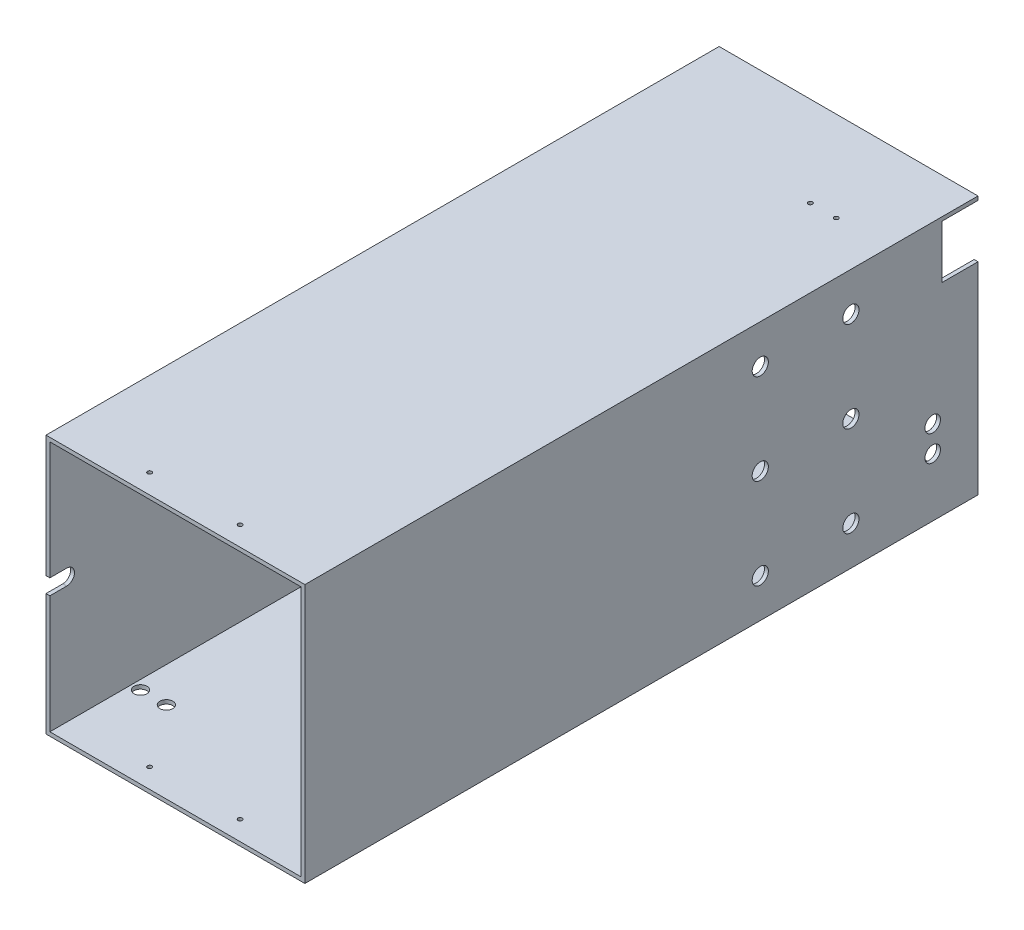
ISO-10303-21;
HEADER;
FILE_DESCRIPTION(('STEP AP214'),'2;1');
FILE_NAME('part.step','',(''),(''),'','','');
FILE_SCHEMA(('AUTOMOTIVE_DESIGN { 1 0 10303 214 1 1 1 1 }'));
ENDSEC;
DATA;
#1=APPLICATION_CONTEXT('core data for automotive mechanical design processes');
#2=APPLICATION_PROTOCOL_DEFINITION('international standard','automotive_design',2000,#1);
#3=PRODUCT_CONTEXT('',#1,'mechanical');
#4=PRODUCT('Part','Part','',(#3));
#5=PRODUCT_RELATED_PRODUCT_CATEGORY('part','',(#4));
#6=PRODUCT_DEFINITION_FORMATION('','',#4);
#7=PRODUCT_DEFINITION_CONTEXT('part definition',#1,'design');
#8=PRODUCT_DEFINITION('design','',#6,#7);
#9=PRODUCT_DEFINITION_SHAPE('','',#8);
#10=(LENGTH_UNIT() NAMED_UNIT(*) SI_UNIT(.MILLI.,.METRE.));
#11=(NAMED_UNIT(*) PLANE_ANGLE_UNIT() SI_UNIT($,.RADIAN.));
#12=(NAMED_UNIT(*) SI_UNIT($,.STERADIAN.) SOLID_ANGLE_UNIT());
#13=UNCERTAINTY_MEASURE_WITH_UNIT(LENGTH_MEASURE(1.E-05),#10,'distance_accuracy_value','');
#14=(GEOMETRIC_REPRESENTATION_CONTEXT(3) GLOBAL_UNCERTAINTY_ASSIGNED_CONTEXT((#13)) GLOBAL_UNIT_ASSIGNED_CONTEXT((#10,
#11,#12)) REPRESENTATION_CONTEXT('',''));
#15=CARTESIAN_POINT('',(0.,0.,0.));
#16=DIRECTION('',(0.,0.,1.));
#17=DIRECTION('',(1.,0.,0.));
#18=AXIS2_PLACEMENT_3D('',#15,#16,#17);
#19=CARTESIAN_POINT('',(0.,0.,520.));
#20=DIRECTION('',(0.,1.,0.));
#21=DIRECTION('',(0.,0.,1.));
#22=AXIS2_PLACEMENT_3D('',#19,#20,#21);
#23=PLANE('',#22);
#24=CARTESIAN_POINT('',(135.,0.,505.));
#25=DIRECTION('',(0.,-1.,0.));
#26=DIRECTION('',(0.,0.,-1.));
#27=AXIS2_PLACEMENT_3D('',#24,#25,#26);
#28=CIRCLE('',#27,1.64999999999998);
#29=CARTESIAN_POINT('',(135.,0.,503.35));
#30=VERTEX_POINT('',#29);
#31=EDGE_CURVE('E444',#30,#30,#28,.T.);
#32=ORIENTED_EDGE('',*,*,#31,.F.);
#33=EDGE_LOOP('',(#32));
#34=FACE_BOUND('',#33,.T.);
#35=CARTESIAN_POINT('',(160.,0.,69.5));
#36=DIRECTION('',(0.,-1.,0.));
#37=DIRECTION('',(0.,0.,-1.));
#38=AXIS2_PLACEMENT_3D('',#35,#36,#37);
#39=CIRCLE('',#38,1.64999999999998);
#40=CARTESIAN_POINT('',(160.,0.,67.85));
#41=VERTEX_POINT('',#40);
#42=EDGE_CURVE('E426',#41,#41,#39,.T.);
#43=ORIENTED_EDGE('',*,*,#42,.F.);
#44=EDGE_LOOP('',(#43));
#45=FACE_BOUND('',#44,.T.);
#46=CARTESIAN_POINT('',(30.,0.,457.));
#47=DIRECTION('',(0.,-1.,0.));
#48=DIRECTION('',(0.,0.,-1.));
#49=AXIS2_PLACEMENT_3D('',#46,#47,#48);
#50=CIRCLE('',#49,5.00000000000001);
#51=CARTESIAN_POINT('',(30.,0.,452.));
#52=VERTEX_POINT('',#51);
#53=EDGE_CURVE('E399',#52,#52,#50,.T.);
#54=ORIENTED_EDGE('',*,*,#53,.F.);
#55=EDGE_LOOP('',(#54));
#56=FACE_BOUND('',#55,.T.);
#57=CARTESIAN_POINT('',(10.,0.,73.));
#58=DIRECTION('',(0.,-1.,0.));
#59=DIRECTION('',(0.,0.,-1.));
#60=AXIS2_PLACEMENT_3D('',#57,#58,#59);
#61=CIRCLE('',#60,5.00000000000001);
#62=CARTESIAN_POINT('',(10.,0.,68.));
#63=VERTEX_POINT('',#62);
#64=EDGE_CURVE('E393',#63,#63,#61,.T.);
#65=ORIENTED_EDGE('',*,*,#64,.F.);
#66=EDGE_LOOP('',(#65));
#67=FACE_BOUND('',#66,.T.);
#68=CARTESIAN_POINT('',(30.,0.,73.));
#69=DIRECTION('',(0.,-1.,0.));
#70=DIRECTION('',(0.,0.,-1.));
#71=AXIS2_PLACEMENT_3D('',#68,#69,#70);
#72=CIRCLE('',#71,5.);
#73=CARTESIAN_POINT('',(30.,0.,68.));
#74=VERTEX_POINT('',#73);
#75=EDGE_CURVE('E387',#74,#74,#72,.T.);
#76=ORIENTED_EDGE('',*,*,#75,.F.);
#77=EDGE_LOOP('',(#76));
#78=FACE_BOUND('',#77,.T.);
#79=CARTESIAN_POINT('',(10.,0.,457.));
#80=DIRECTION('',(0.,-1.,0.));
#81=DIRECTION('',(0.,0.,-1.));
#82=AXIS2_PLACEMENT_3D('',#79,#80,#81);
#83=CIRCLE('',#82,5.00000000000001);
#84=CARTESIAN_POINT('',(10.,0.,452.));
#85=VERTEX_POINT('',#84);
#86=EDGE_CURVE('E378',#85,#85,#83,.T.);
#87=ORIENTED_EDGE('',*,*,#86,.F.);
#88=EDGE_LOOP('',(#87));
#89=FACE_BOUND('',#88,.T.);
#90=DIRECTION('',(-1.,0.,0.));
#91=VECTOR('',#90,1.);
#92=CARTESIAN_POINT('',(44.,0.,28.));
#93=LINE('',#92,#91);
#94=CARTESIAN_POINT('',(44.,0.,28.));
#95=VERTEX_POINT('',#94);
#96=CARTESIAN_POINT('',(3.,0.,28.));
#97=VERTEX_POINT('',#96);
#98=EDGE_CURVE('E161',#95,#97,#93,.T.);
#99=ORIENTED_EDGE('',*,*,#98,.F.);
#100=DIRECTION('',(0.,0.,1.));
#101=VECTOR('',#100,1.);
#102=CARTESIAN_POINT('',(44.,0.,0.));
#103=LINE('',#102,#101);
#104=CARTESIAN_POINT('',(44.,0.,0.));
#105=VERTEX_POINT('',#104);
#106=EDGE_CURVE('E166',#105,#95,#103,.T.);
#107=ORIENTED_EDGE('',*,*,#106,.F.);
#108=DIRECTION('',(1.,0.,0.));
#109=VECTOR('',#108,1.);
#110=CARTESIAN_POINT('',(0.,0.,0.));
#111=LINE('',#110,#109);
#112=CARTESIAN_POINT('',(200.,0.,0.));
#113=VERTEX_POINT('',#112);
#114=EDGE_CURVE('E213',#105,#113,#111,.T.);
#115=ORIENTED_EDGE('',*,*,#114,.T.);
#116=DIRECTION('',(0.,0.,-1.));
#117=VECTOR('',#116,1.);
#118=CARTESIAN_POINT('',(200.,0.,520.));
#119=LINE('',#118,#117);
#120=CARTESIAN_POINT('',(200.,0.,520.));
#121=VERTEX_POINT('',#120);
#122=EDGE_CURVE('E38',#121,#113,#119,.T.);
#123=ORIENTED_EDGE('',*,*,#122,.F.);
#124=DIRECTION('',(1.,0.,0.));
#125=VECTOR('',#124,1.);
#126=CARTESIAN_POINT('',(0.,0.,520.));
#127=LINE('',#126,#125);
#128=CARTESIAN_POINT('',(0.,0.,520.));
#129=VERTEX_POINT('',#128);
#130=EDGE_CURVE('E203',#129,#121,#127,.T.);
#131=ORIENTED_EDGE('',*,*,#130,.F.);
#132=DIRECTION('',(0.,0.,-1.));
#133=VECTOR('',#132,1.);
#134=CARTESIAN_POINT('',(0.,0.,520.));
#135=LINE('',#134,#133);
#136=CARTESIAN_POINT('',(0.,0.,0.));
#137=VERTEX_POINT('',#136);
#138=EDGE_CURVE('E11',#129,#137,#135,.T.);
#139=ORIENTED_EDGE('',*,*,#138,.T.);
#140=CARTESIAN_POINT('',(3.,0.,0.));
#141=VERTEX_POINT('',#140);
#142=EDGE_CURVE('E214',#137,#141,#111,.T.);
#143=ORIENTED_EDGE('',*,*,#142,.T.);
#144=DIRECTION('',(0.,0.,-1.));
#145=VECTOR('',#144,1.);
#146=CARTESIAN_POINT('',(3.,0.,28.));
#147=LINE('',#146,#145);
#148=EDGE_CURVE('E325',#97,#141,#147,.T.);
#149=ORIENTED_EDGE('',*,*,#148,.F.);
#150=EDGE_LOOP('',(#99,#107,#115,#123,#131,#139,#143,#149));
#151=FACE_BOUND('',#150,.T.);
#152=CARTESIAN_POINT('',(140.,0.,69.5));
#153=DIRECTION('',(0.,-1.,0.));
#154=DIRECTION('',(0.,0.,-1.));
#155=AXIS2_PLACEMENT_3D('',#152,#153,#154);
#156=CIRCLE('',#155,1.64999999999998);
#157=CARTESIAN_POINT('',(140.,0.,67.85));
#158=VERTEX_POINT('',#157);
#159=EDGE_CURVE('E438',#158,#158,#156,.T.);
#160=ORIENTED_EDGE('',*,*,#159,.F.);
#161=EDGE_LOOP('',(#160));
#162=FACE_BOUND('',#161,.T.);
#163=CARTESIAN_POINT('',(65.,0.,505.));
#164=DIRECTION('',(0.,-1.,0.));
#165=DIRECTION('',(0.,0.,-1.));
#166=AXIS2_PLACEMENT_3D('',#163,#164,#165);
#167=CIRCLE('',#166,1.64999999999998);
#168=CARTESIAN_POINT('',(65.,0.,503.35));
#169=VERTEX_POINT('',#168);
#170=EDGE_CURVE('E450',#169,#169,#167,.T.);
#171=ORIENTED_EDGE('',*,*,#170,.F.);
#172=EDGE_LOOP('',(#171));
#173=FACE_BOUND('',#172,.T.);
#174=ADVANCED_FACE('F30',(#34,#45,#56,#67,#78,#89,#151,#162,#173),#23,.F.);
#175=CARTESIAN_POINT('',(0.,200.,0.));
#176=DIRECTION('',(0.,0.,-1.));
#177=DIRECTION('',(-1.,0.,0.));
#178=AXIS2_PLACEMENT_3D('',#175,#176,#177);
#179=PLANE('',#178);
#180=DIRECTION('',(0.,-1.,0.));
#181=VECTOR('',#180,1.);
#182=CARTESIAN_POINT('',(44.,200.001,0.));
#183=LINE('',#182,#181);
#184=CARTESIAN_POINT('',(44.,3.,0.));
#185=VERTEX_POINT('',#184);
#186=EDGE_CURVE('E176',#185,#105,#183,.T.);
#187=ORIENTED_EDGE('',*,*,#186,.F.);
#188=DIRECTION('',(1.,0.,0.));
#189=VECTOR('',#188,1.);
#190=CARTESIAN_POINT('',(3.,3.,0.));
#191=LINE('',#190,#189);
#192=CARTESIAN_POINT('',(197.,3.,0.));
#193=VERTEX_POINT('',#192);
#194=EDGE_CURVE('E309',#185,#193,#191,.T.);
#195=ORIENTED_EDGE('',*,*,#194,.T.);
#196=DIRECTION('',(0.,1.,0.));
#197=VECTOR('',#196,1.);
#198=CARTESIAN_POINT('',(197.,3.,0.));
#199=LINE('',#198,#197);
#200=CARTESIAN_POINT('',(197.,156.,0.));
#201=VERTEX_POINT('',#200);
#202=EDGE_CURVE('E245',#193,#201,#199,.T.);
#203=ORIENTED_EDGE('',*,*,#202,.T.);
#204=DIRECTION('',(1.,0.,0.));
#205=VECTOR('',#204,1.);
#206=CARTESIAN_POINT('',(-0.001000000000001,156.,0.));
#207=LINE('',#206,#205);
#208=CARTESIAN_POINT('',(200.,156.,0.));
#209=VERTEX_POINT('',#208);
#210=EDGE_CURVE('E243',#201,#209,#207,.T.);
#211=ORIENTED_EDGE('',*,*,#210,.T.);
#212=DIRECTION('',(0.,1.,0.));
#213=VECTOR('',#212,1.);
#214=CARTESIAN_POINT('',(200.,0.,0.));
#215=LINE('',#214,#213);
#216=EDGE_CURVE('E218',#113,#209,#215,.T.);
#217=ORIENTED_EDGE('',*,*,#216,.F.);
#218=ORIENTED_EDGE('',*,*,#114,.F.);
#219=EDGE_LOOP('',(#187,#195,#203,#211,#217,#218));
#220=FACE_BOUND('',#219,.T.);
#221=ADVANCED_FACE('F241',(#220),#179,.T.);
#222=CARTESIAN_POINT('',(0.,200.,520.));
#223=DIRECTION('',(0.,0.,-1.));
#224=DIRECTION('',(-1.,0.,0.));
#225=AXIS2_PLACEMENT_3D('',#222,#223,#224);
#226=PLANE('',#225);
#227=DIRECTION('',(0.,-1.,0.));
#228=VECTOR('',#227,1.);
#229=CARTESIAN_POINT('',(3.,3.,520.));
#230=LINE('',#229,#228);
#231=CARTESIAN_POINT('',(3.00000000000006,94.,520.));
#232=VERTEX_POINT('',#231);
#233=CARTESIAN_POINT('',(3.,3.,520.));
#234=VERTEX_POINT('',#233);
#235=EDGE_CURVE('E182',#232,#234,#230,.T.);
#236=ORIENTED_EDGE('',*,*,#235,.F.);
#237=DIRECTION('',(-1.,0.,0.));
#238=VECTOR('',#237,1.);
#239=CARTESIAN_POINT('',(200.001,94.,520.));
#240=LINE('',#239,#238);
#241=CARTESIAN_POINT('',(0.,94.,520.));
#242=VERTEX_POINT('',#241);
#243=EDGE_CURVE('E356',#232,#242,#240,.T.);
#244=ORIENTED_EDGE('',*,*,#243,.T.);
#245=DIRECTION('',(0.,-1.,0.));
#246=VECTOR('',#245,1.);
#247=CARTESIAN_POINT('',(0.,0.,520.));
#248=LINE('',#247,#246);
#249=EDGE_CURVE('E204',#242,#129,#248,.T.);
#250=ORIENTED_EDGE('',*,*,#249,.T.);
#251=ORIENTED_EDGE('',*,*,#130,.T.);
#252=DIRECTION('',(0.,1.,0.));
#253=VECTOR('',#252,1.);
#254=CARTESIAN_POINT('',(200.,0.,520.));
#255=LINE('',#254,#253);
#256=CARTESIAN_POINT('',(200.,200.,520.));
#257=VERTEX_POINT('',#256);
#258=EDGE_CURVE('E206',#121,#257,#255,.T.);
#259=ORIENTED_EDGE('',*,*,#258,.T.);
#260=DIRECTION('',(-1.,0.,0.));
#261=VECTOR('',#260,1.);
#262=CARTESIAN_POINT('',(0.,200.,520.));
#263=LINE('',#262,#261);
#264=CARTESIAN_POINT('',(0.,200.,520.));
#265=VERTEX_POINT('',#264);
#266=EDGE_CURVE('E208',#257,#265,#263,.T.);
#267=ORIENTED_EDGE('',*,*,#266,.T.);
#268=CARTESIAN_POINT('',(0.,106.,520.));
#269=VERTEX_POINT('',#268);
#270=EDGE_CURVE('E200',#265,#269,#248,.T.);
#271=ORIENTED_EDGE('',*,*,#270,.T.);
#272=DIRECTION('',(-1.,0.,0.));
#273=VECTOR('',#272,1.);
#274=CARTESIAN_POINT('',(200.001,106.,520.));
#275=LINE('',#274,#273);
#276=CARTESIAN_POINT('',(3.,106.,520.));
#277=VERTEX_POINT('',#276);
#278=EDGE_CURVE('E360',#277,#269,#275,.T.);
#279=ORIENTED_EDGE('',*,*,#278,.F.);
#280=CARTESIAN_POINT('',(3.,197.,520.));
#281=VERTEX_POINT('',#280);
#282=EDGE_CURVE('E184',#281,#277,#230,.T.);
#283=ORIENTED_EDGE('',*,*,#282,.F.);
#284=DIRECTION('',(-1.,0.,0.));
#285=VECTOR('',#284,1.);
#286=CARTESIAN_POINT('',(3.,197.,520.));
#287=LINE('',#286,#285);
#288=CARTESIAN_POINT('',(197.,197.,520.));
#289=VERTEX_POINT('',#288);
#290=EDGE_CURVE('E314',#289,#281,#287,.T.);
#291=ORIENTED_EDGE('',*,*,#290,.F.);
#292=DIRECTION('',(0.,1.,0.));
#293=VECTOR('',#292,1.);
#294=CARTESIAN_POINT('',(197.,3.,520.));
#295=LINE('',#294,#293);
#296=CARTESIAN_POINT('',(197.,3.,520.));
#297=VERTEX_POINT('',#296);
#298=EDGE_CURVE('E312',#297,#289,#295,.T.);
#299=ORIENTED_EDGE('',*,*,#298,.F.);
#300=DIRECTION('',(1.,0.,0.));
#301=VECTOR('',#300,1.);
#302=CARTESIAN_POINT('',(3.,3.,520.));
#303=LINE('',#302,#301);
#304=EDGE_CURVE('E310',#234,#297,#303,.T.);
#305=ORIENTED_EDGE('',*,*,#304,.F.);
#306=EDGE_LOOP('',(#236,#244,#250,#251,#259,#267,#271,#279,#283,#291,#299,#305));
#307=FACE_BOUND('',#306,.T.);
#308=ADVANCED_FACE('F461',(#307),#226,.F.);
#309=DIRECTION('',(0.,-1.,0.));
#310=VECTOR('',#309,1.);
#311=CARTESIAN_POINT('',(3.,3.,0.));
#312=LINE('',#311,#310);
#313=CARTESIAN_POINT('',(3.,197.,0.));
#314=VERTEX_POINT('',#313);
#315=EDGE_CURVE('E191',#314,#141,#312,.T.);
#316=ORIENTED_EDGE('',*,*,#315,.T.);
#317=ORIENTED_EDGE('',*,*,#142,.F.);
#318=DIRECTION('',(0.,-1.,0.));
#319=VECTOR('',#318,1.);
#320=CARTESIAN_POINT('',(0.,0.,0.));
#321=LINE('',#320,#319);
#322=CARTESIAN_POINT('',(0.,200.,0.));
#323=VERTEX_POINT('',#322);
#324=EDGE_CURVE('E199',#323,#137,#321,.T.);
#325=ORIENTED_EDGE('',*,*,#324,.F.);
#326=DIRECTION('',(-1.,0.,0.));
#327=VECTOR('',#326,1.);
#328=CARTESIAN_POINT('',(0.,200.,0.));
#329=LINE('',#328,#327);
#330=CARTESIAN_POINT('',(200.,200.,0.));
#331=VERTEX_POINT('',#330);
#332=EDGE_CURVE('E221',#331,#323,#329,.T.);
#333=ORIENTED_EDGE('',*,*,#332,.F.);
#334=CARTESIAN_POINT('',(200.,197.,0.));
#335=VERTEX_POINT('',#334);
#336=EDGE_CURVE('E217',#335,#331,#215,.T.);
#337=ORIENTED_EDGE('',*,*,#336,.F.);
#338=DIRECTION('',(-1.,0.,0.));
#339=VECTOR('',#338,1.);
#340=CARTESIAN_POINT('',(3.,197.,0.));
#341=LINE('',#340,#339);
#342=EDGE_CURVE('E318',#335,#314,#341,.T.);
#343=ORIENTED_EDGE('',*,*,#342,.T.);
#344=EDGE_LOOP('',(#316,#317,#325,#333,#337,#343));
#345=FACE_BOUND('',#344,.T.);
#346=ADVANCED_FACE('F323',(#345),#179,.T.);
#347=CARTESIAN_POINT('',(0.,0.,520.));
#348=DIRECTION('',(1.,0.,0.));
#349=DIRECTION('',(0.,0.,-1.));
#350=AXIS2_PLACEMENT_3D('',#347,#348,#349);
#351=PLANE('',#350);
#352=ORIENTED_EDGE('',*,*,#249,.F.);
#353=DIRECTION('',(0.,0.,1.));
#354=VECTOR('',#353,1.);
#355=CARTESIAN_POINT('',(0.,94.,520.));
#356=LINE('',#355,#354);
#357=CARTESIAN_POINT('',(0.,94.,507.));
#358=VERTEX_POINT('',#357);
#359=EDGE_CURVE('E365',#358,#242,#356,.T.);
#360=ORIENTED_EDGE('',*,*,#359,.F.);
#361=CARTESIAN_POINT('',(0.,100.,507.));
#362=DIRECTION('',(-1.,0.,0.));
#363=DIRECTION('',(0.,0.,1.));
#364=AXIS2_PLACEMENT_3D('',#361,#362,#363);
#365=CIRCLE('',#364,5.99999999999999);
#366=CARTESIAN_POINT('',(0.,106.,507.));
#367=VERTEX_POINT('',#366);
#368=EDGE_CURVE('E367',#367,#358,#365,.T.);
#369=ORIENTED_EDGE('',*,*,#368,.F.);
#370=DIRECTION('',(0.,0.,-1.));
#371=VECTOR('',#370,1.);
#372=CARTESIAN_POINT('',(0.,106.,507.));
#373=LINE('',#372,#371);
#374=EDGE_CURVE('E357',#269,#367,#373,.T.);
#375=ORIENTED_EDGE('',*,*,#374,.F.);
#376=ORIENTED_EDGE('',*,*,#270,.F.);
#377=DIRECTION('',(0.,0.,-1.));
#378=VECTOR('',#377,1.);
#379=CARTESIAN_POINT('',(0.,200.,520.));
#380=LINE('',#379,#378);
#381=EDGE_CURVE('E210',#265,#323,#380,.T.);
#382=ORIENTED_EDGE('',*,*,#381,.T.);
#383=ORIENTED_EDGE('',*,*,#324,.T.);
#384=ORIENTED_EDGE('',*,*,#138,.F.);
#385=EDGE_LOOP('',(#352,#360,#369,#375,#376,#382,#383,#384));
#386=FACE_BOUND('',#385,.T.);
#387=CARTESIAN_POINT('',(0.,64.9999999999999,35.));
#388=DIRECTION('',(-1.,0.,0.));
#389=DIRECTION('',(0.,0.,1.));
#390=AXIS2_PLACEMENT_3D('',#387,#388,#389);
#391=CIRCLE('',#390,2.5);
#392=CARTESIAN_POINT('',(0.,64.9999999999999,37.5));
#393=VERTEX_POINT('',#392);
#394=EDGE_CURVE('E254',#393,#393,#391,.T.);
#395=ORIENTED_EDGE('',*,*,#394,.F.);
#396=EDGE_LOOP('',(#395));
#397=FACE_BOUND('',#396,.T.);
#398=ADVANCED_FACE('F32',(#386,#397),#351,.F.);
#399=CARTESIAN_POINT('',(200.,0.,520.));
#400=DIRECTION('',(-1.,0.,0.));
#401=DIRECTION('',(0.,0.,1.));
#402=AXIS2_PLACEMENT_3D('',#399,#400,#401);
#403=PLANE('',#402);
#404=CARTESIAN_POINT('',(200.,45.,35.));
#405=DIRECTION('',(1.,0.,0.));
#406=DIRECTION('',(0.,0.,-1.));
#407=AXIS2_PLACEMENT_3D('',#404,#405,#406);
#408=CIRCLE('',#407,6.);
#409=CARTESIAN_POINT('',(200.,45.,29.));
#410=VERTEX_POINT('',#409);
#411=EDGE_CURVE('E263',#410,#410,#408,.T.);
#412=ORIENTED_EDGE('',*,*,#411,.F.);
#413=EDGE_LOOP('',(#412));
#414=FACE_BOUND('',#413,.T.);
#415=CARTESIAN_POINT('',(200.,65.,35.));
#416=DIRECTION('',(1.,0.,0.));
#417=DIRECTION('',(0.,0.,-1.));
#418=AXIS2_PLACEMENT_3D('',#415,#416,#417);
#419=CIRCLE('',#418,6.);
#420=CARTESIAN_POINT('',(200.,65.,29.));
#421=VERTEX_POINT('',#420);
#422=EDGE_CURVE('E270',#421,#421,#419,.T.);
#423=ORIENTED_EDGE('',*,*,#422,.F.);
#424=EDGE_LOOP('',(#423));
#425=FACE_BOUND('',#424,.T.);
#426=CARTESIAN_POINT('',(200.,30.,168.2));
#427=DIRECTION('',(1.,0.,0.));
#428=DIRECTION('',(0.,0.,-1.));
#429=AXIS2_PLACEMENT_3D('',#426,#427,#428);
#430=CIRCLE('',#429,6.25);
#431=CARTESIAN_POINT('',(200.,30.,161.95));
#432=VERTEX_POINT('',#431);
#433=EDGE_CURVE('E276',#432,#432,#430,.T.);
#434=ORIENTED_EDGE('',*,*,#433,.F.);
#435=EDGE_LOOP('',(#434));
#436=FACE_BOUND('',#435,.T.);
#437=CARTESIAN_POINT('',(200.,30.,98.2));
#438=DIRECTION('',(1.,0.,0.));
#439=DIRECTION('',(0.,0.,-1.));
#440=AXIS2_PLACEMENT_3D('',#437,#438,#439);
#441=CIRCLE('',#440,6.25000000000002);
#442=CARTESIAN_POINT('',(200.,30.,91.9499999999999));
#443=VERTEX_POINT('',#442);
#444=EDGE_CURVE('E282',#443,#443,#441,.T.);
#445=ORIENTED_EDGE('',*,*,#444,.F.);
#446=EDGE_LOOP('',(#445));
#447=FACE_BOUND('',#446,.T.);
#448=CARTESIAN_POINT('',(200.,100.,168.2));
#449=DIRECTION('',(1.,0.,0.));
#450=DIRECTION('',(0.,0.,-1.));
#451=AXIS2_PLACEMENT_3D('',#448,#449,#450);
#452=CIRCLE('',#451,6.25);
#453=CARTESIAN_POINT('',(200.,100.,161.95));
#454=VERTEX_POINT('',#453);
#455=EDGE_CURVE('E288',#454,#454,#452,.T.);
#456=ORIENTED_EDGE('',*,*,#455,.F.);
#457=EDGE_LOOP('',(#456));
#458=FACE_BOUND('',#457,.T.);
#459=CARTESIAN_POINT('',(200.,100.,98.2));
#460=DIRECTION('',(1.,0.,0.));
#461=DIRECTION('',(0.,0.,-1.));
#462=AXIS2_PLACEMENT_3D('',#459,#460,#461);
#463=CIRCLE('',#462,6.25);
#464=CARTESIAN_POINT('',(200.,100.,91.95));
#465=VERTEX_POINT('',#464);
#466=EDGE_CURVE('E294',#465,#465,#463,.T.);
#467=ORIENTED_EDGE('',*,*,#466,.F.);
#468=EDGE_LOOP('',(#467));
#469=FACE_BOUND('',#468,.T.);
#470=CARTESIAN_POINT('',(200.,170.,168.2));
#471=DIRECTION('',(1.,0.,0.));
#472=DIRECTION('',(0.,0.,-1.));
#473=AXIS2_PLACEMENT_3D('',#470,#471,#472);
#474=CIRCLE('',#473,6.25000000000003);
#475=CARTESIAN_POINT('',(200.,170.,161.95));
#476=VERTEX_POINT('',#475);
#477=EDGE_CURVE('E300',#476,#476,#474,.T.);
#478=ORIENTED_EDGE('',*,*,#477,.F.);
#479=EDGE_LOOP('',(#478));
#480=FACE_BOUND('',#479,.T.);
#481=CARTESIAN_POINT('',(200.,170.,98.2));
#482=DIRECTION('',(1.,0.,0.));
#483=DIRECTION('',(0.,0.,-1.));
#484=AXIS2_PLACEMENT_3D('',#481,#482,#483);
#485=CIRCLE('',#484,6.25000000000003);
#486=CARTESIAN_POINT('',(200.,170.,91.9499999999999));
#487=VERTEX_POINT('',#486);
#488=EDGE_CURVE('E306',#487,#487,#485,.T.);
#489=ORIENTED_EDGE('',*,*,#488,.F.);
#490=EDGE_LOOP('',(#489));
#491=FACE_BOUND('',#490,.T.);
#492=ORIENTED_EDGE('',*,*,#216,.T.);
#493=DIRECTION('',(0.,0.,-1.));
#494=VECTOR('',#493,1.);
#495=CARTESIAN_POINT('',(200.,156.,0.));
#496=LINE('',#495,#494);
#497=CARTESIAN_POINT('',(200.,156.,28.));
#498=VERTEX_POINT('',#497);
#499=EDGE_CURVE('E264',#498,#209,#496,.T.);
#500=ORIENTED_EDGE('',*,*,#499,.F.);
#501=DIRECTION('',(0.,-1.,0.));
#502=VECTOR('',#501,1.);
#503=CARTESIAN_POINT('',(200.,197.,28.));
#504=LINE('',#503,#502);
#505=CARTESIAN_POINT('',(200.,197.,28.));
#506=VERTEX_POINT('',#505);
#507=EDGE_CURVE('E342',#506,#498,#504,.T.);
#508=ORIENTED_EDGE('',*,*,#507,.F.);
#509=DIRECTION('',(0.,0.,1.));
#510=VECTOR('',#509,1.);
#511=CARTESIAN_POINT('',(200.,197.,0.));
#512=LINE('',#511,#510);
#513=EDGE_CURVE('E259',#335,#506,#512,.T.);
#514=ORIENTED_EDGE('',*,*,#513,.F.);
#515=ORIENTED_EDGE('',*,*,#336,.T.);
#516=DIRECTION('',(0.,0.,-1.));
#517=VECTOR('',#516,1.);
#518=CARTESIAN_POINT('',(200.,200.,520.));
#519=LINE('',#518,#517);
#520=EDGE_CURVE('E225',#257,#331,#519,.T.);
#521=ORIENTED_EDGE('',*,*,#520,.F.);
#522=ORIENTED_EDGE('',*,*,#258,.F.);
#523=ORIENTED_EDGE('',*,*,#122,.T.);
#524=EDGE_LOOP('',(#492,#500,#508,#514,#515,#521,#522,#523));
#525=FACE_BOUND('',#524,.T.);
#526=ADVANCED_FACE('F232',(#414,#425,#436,#447,#458,#469,#480,#491,#525),#403,.F.);
#527=CARTESIAN_POINT('',(0.,200.,520.));
#528=DIRECTION('',(0.,-1.,0.));
#529=DIRECTION('',(0.,0.,-1.));
#530=AXIS2_PLACEMENT_3D('',#527,#528,#529);
#531=PLANE('',#530);
#532=CARTESIAN_POINT('',(140.,200.,69.5));
#533=DIRECTION('',(0.,-1.,0.));
#534=DIRECTION('',(0.,0.,-1.));
#535=AXIS2_PLACEMENT_3D('',#532,#533,#534);
#536=CIRCLE('',#535,1.64999999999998);
#537=CARTESIAN_POINT('',(140.,200.,67.85));
#538=VERTEX_POINT('',#537);
#539=EDGE_CURVE('E435',#538,#538,#536,.T.);
#540=ORIENTED_EDGE('',*,*,#539,.T.);
#541=EDGE_LOOP('',(#540));
#542=FACE_BOUND('',#541,.T.);
#543=CARTESIAN_POINT('',(160.,200.,69.5));
#544=DIRECTION('',(0.,-1.,0.));
#545=DIRECTION('',(0.,0.,-1.));
#546=AXIS2_PLACEMENT_3D('',#543,#544,#545);
#547=CIRCLE('',#546,1.64999999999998);
#548=CARTESIAN_POINT('',(160.,200.,67.85));
#549=VERTEX_POINT('',#548);
#550=EDGE_CURVE('E423',#549,#549,#547,.T.);
#551=ORIENTED_EDGE('',*,*,#550,.T.);
#552=EDGE_LOOP('',(#551));
#553=FACE_BOUND('',#552,.T.);
#554=CARTESIAN_POINT('',(65.,200.,505.));
#555=DIRECTION('',(0.,1.,0.));
#556=DIRECTION('',(0.,0.,1.));
#557=AXIS2_PLACEMENT_3D('',#554,#555,#556);
#558=CIRCLE('',#557,1.64999999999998);
#559=CARTESIAN_POINT('',(65.,200.,506.65));
#560=VERTEX_POINT('',#559);
#561=EDGE_CURVE('E414',#560,#560,#558,.T.);
#562=ORIENTED_EDGE('',*,*,#561,.F.);
#563=EDGE_LOOP('',(#562));
#564=FACE_BOUND('',#563,.T.);
#565=CARTESIAN_POINT('',(135.,200.,505.));
#566=DIRECTION('',(0.,1.,0.));
#567=DIRECTION('',(0.,0.,1.));
#568=AXIS2_PLACEMENT_3D('',#565,#566,#567);
#569=CIRCLE('',#568,1.64999999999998);
#570=CARTESIAN_POINT('',(135.,200.,506.65));
#571=VERTEX_POINT('',#570);
#572=EDGE_CURVE('E408',#571,#571,#569,.T.);
#573=ORIENTED_EDGE('',*,*,#572,.F.);
#574=EDGE_LOOP('',(#573));
#575=FACE_BOUND('',#574,.T.);
#576=ORIENTED_EDGE('',*,*,#332,.T.);
#577=ORIENTED_EDGE('',*,*,#381,.F.);
#578=ORIENTED_EDGE('',*,*,#266,.F.);
#579=ORIENTED_EDGE('',*,*,#520,.T.);
#580=EDGE_LOOP('',(#576,#577,#578,#579));
#581=FACE_BOUND('',#580,.T.);
#582=ADVANCED_FACE('F337',(#542,#553,#564,#575,#581),#531,.F.);
#583=CARTESIAN_POINT('',(3.,3.,520.));
#584=DIRECTION('',(0.,1.,0.));
#585=DIRECTION('',(0.,0.,1.));
#586=AXIS2_PLACEMENT_3D('',#583,#584,#585);
#587=PLANE('',#586);
#588=CARTESIAN_POINT('',(65.,3.,505.));
#589=DIRECTION('',(0.,1.,0.));
#590=DIRECTION('',(0.,0.,1.));
#591=AXIS2_PLACEMENT_3D('',#588,#589,#590);
#592=CIRCLE('',#591,1.64999999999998);
#593=CARTESIAN_POINT('',(65.,3.,506.65));
#594=VERTEX_POINT('',#593);
#595=EDGE_CURVE('E447',#594,#594,#592,.T.);
#596=ORIENTED_EDGE('',*,*,#595,.F.);
#597=EDGE_LOOP('',(#596));
#598=FACE_BOUND('',#597,.T.);
#599=CARTESIAN_POINT('',(135.,3.,505.));
#600=DIRECTION('',(0.,1.,0.));
#601=DIRECTION('',(0.,0.,1.));
#602=AXIS2_PLACEMENT_3D('',#599,#600,#601);
#603=CIRCLE('',#602,1.64999999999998);
#604=CARTESIAN_POINT('',(135.,3.,506.65));
#605=VERTEX_POINT('',#604);
#606=EDGE_CURVE('E441',#605,#605,#603,.T.);
#607=ORIENTED_EDGE('',*,*,#606,.F.);
#608=EDGE_LOOP('',(#607));
#609=FACE_BOUND('',#608,.T.);
#610=CARTESIAN_POINT('',(140.,3.,69.5));
#611=DIRECTION('',(0.,1.,0.));
#612=DIRECTION('',(0.,0.,1.));
#613=AXIS2_PLACEMENT_3D('',#610,#611,#612);
#614=CIRCLE('',#613,1.64999999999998);
#615=CARTESIAN_POINT('',(140.,3.,71.15));
#616=VERTEX_POINT('',#615);
#617=EDGE_CURVE('E429',#616,#616,#614,.T.);
#618=ORIENTED_EDGE('',*,*,#617,.F.);
#619=EDGE_LOOP('',(#618));
#620=FACE_BOUND('',#619,.T.);
#621=CARTESIAN_POINT('',(160.,3.,69.5));
#622=DIRECTION('',(0.,1.,0.));
#623=DIRECTION('',(0.,0.,1.));
#624=AXIS2_PLACEMENT_3D('',#621,#622,#623);
#625=CIRCLE('',#624,1.64999999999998);
#626=CARTESIAN_POINT('',(160.,3.,71.15));
#627=VERTEX_POINT('',#626);
#628=EDGE_CURVE('E417',#627,#627,#625,.T.);
#629=ORIENTED_EDGE('',*,*,#628,.F.);
#630=EDGE_LOOP('',(#629));
#631=FACE_BOUND('',#630,.T.);
#632=CARTESIAN_POINT('',(30.,3.,457.));
#633=DIRECTION('',(0.,1.,0.));
#634=DIRECTION('',(0.,0.,1.));
#635=AXIS2_PLACEMENT_3D('',#632,#633,#634);
#636=CIRCLE('',#635,5.00000000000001);
#637=CARTESIAN_POINT('',(30.,3.,452.));
#638=VERTEX_POINT('',#637);
#639=EDGE_CURVE('E402',#638,#638,#636,.F.);
#640=ORIENTED_EDGE('',*,*,#639,.T.);
#641=EDGE_LOOP('',(#640));
#642=FACE_BOUND('',#641,.T.);
#643=CARTESIAN_POINT('',(10.,3.,73.));
#644=DIRECTION('',(0.,1.,0.));
#645=DIRECTION('',(0.,0.,1.));
#646=AXIS2_PLACEMENT_3D('',#643,#644,#645);
#647=CIRCLE('',#646,5.00000000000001);
#648=CARTESIAN_POINT('',(10.,3.,68.));
#649=VERTEX_POINT('',#648);
#650=EDGE_CURVE('E396',#649,#649,#647,.F.);
#651=ORIENTED_EDGE('',*,*,#650,.T.);
#652=EDGE_LOOP('',(#651));
#653=FACE_BOUND('',#652,.T.);
#654=CARTESIAN_POINT('',(30.,3.,73.));
#655=DIRECTION('',(0.,1.,0.));
#656=DIRECTION('',(0.,0.,1.));
#657=AXIS2_PLACEMENT_3D('',#654,#655,#656);
#658=CIRCLE('',#657,5.);
#659=CARTESIAN_POINT('',(30.,3.,68.));
#660=VERTEX_POINT('',#659);
#661=EDGE_CURVE('E390',#660,#660,#658,.F.);
#662=ORIENTED_EDGE('',*,*,#661,.T.);
#663=EDGE_LOOP('',(#662));
#664=FACE_BOUND('',#663,.T.);
#665=CARTESIAN_POINT('',(10.,3.,457.));
#666=DIRECTION('',(0.,1.,0.));
#667=DIRECTION('',(0.,0.,1.));
#668=AXIS2_PLACEMENT_3D('',#665,#666,#667);
#669=CIRCLE('',#668,5.00000000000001);
#670=CARTESIAN_POINT('',(10.,3.,452.));
#671=VERTEX_POINT('',#670);
#672=EDGE_CURVE('E384',#671,#671,#669,.F.);
#673=ORIENTED_EDGE('',*,*,#672,.T.);
#674=EDGE_LOOP('',(#673));
#675=FACE_BOUND('',#674,.T.);
#676=DIRECTION('',(0.,0.,1.));
#677=VECTOR('',#676,1.);
#678=CARTESIAN_POINT('',(44.,3.,0.));
#679=LINE('',#678,#677);
#680=CARTESIAN_POINT('',(44.,3.,28.));
#681=VERTEX_POINT('',#680);
#682=EDGE_CURVE('E175',#185,#681,#679,.T.);
#683=ORIENTED_EDGE('',*,*,#682,.T.);
#684=DIRECTION('',(-1.,0.,0.));
#685=VECTOR('',#684,1.);
#686=CARTESIAN_POINT('',(44.,3.,28.));
#687=LINE('',#686,#685);
#688=CARTESIAN_POINT('',(3.,3.00000000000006,28.));
#689=VERTEX_POINT('',#688);
#690=EDGE_CURVE('E158',#681,#689,#687,.T.);
#691=ORIENTED_EDGE('',*,*,#690,.T.);
#692=DIRECTION('',(0.,0.,-1.));
#693=VECTOR('',#692,1.);
#694=CARTESIAN_POINT('',(3.,3.,520.));
#695=LINE('',#694,#693);
#696=EDGE_CURVE('E172',#234,#689,#695,.T.);
#697=ORIENTED_EDGE('',*,*,#696,.F.);
#698=ORIENTED_EDGE('',*,*,#304,.T.);
#699=DIRECTION('',(0.,0.,-1.));
#700=VECTOR('',#699,1.);
#701=CARTESIAN_POINT('',(197.,3.,520.));
#702=LINE('',#701,#700);
#703=EDGE_CURVE('E196',#297,#193,#702,.T.);
#704=ORIENTED_EDGE('',*,*,#703,.T.);
#705=ORIENTED_EDGE('',*,*,#194,.F.);
#706=EDGE_LOOP('',(#683,#691,#697,#698,#704,#705));
#707=FACE_BOUND('',#706,.T.);
#708=ADVANCED_FACE('F171',(#598,#609,#620,#631,#642,#653,#664,#675,#707),#587,.T.);
#709=CARTESIAN_POINT('',(197.,3.,520.));
#710=DIRECTION('',(-1.,0.,0.));
#711=DIRECTION('',(0.,0.,1.));
#712=AXIS2_PLACEMENT_3D('',#709,#710,#711);
#713=PLANE('',#712);
#714=DIRECTION('',(0.,0.,-1.));
#715=VECTOR('',#714,1.);
#716=CARTESIAN_POINT('',(197.,156.,0.));
#717=LINE('',#716,#715);
#718=CARTESIAN_POINT('',(197.,156.,28.));
#719=VERTEX_POINT('',#718);
#720=EDGE_CURVE('E249',#719,#201,#717,.T.);
#721=ORIENTED_EDGE('',*,*,#720,.T.);
#722=ORIENTED_EDGE('',*,*,#202,.F.);
#723=ORIENTED_EDGE('',*,*,#703,.F.);
#724=ORIENTED_EDGE('',*,*,#298,.T.);
#725=DIRECTION('',(0.,0.,-1.));
#726=VECTOR('',#725,1.);
#727=CARTESIAN_POINT('',(197.,197.,520.));
#728=LINE('',#727,#726);
#729=CARTESIAN_POINT('',(197.,197.,28.0000000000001));
#730=VERTEX_POINT('',#729);
#731=EDGE_CURVE('E186',#289,#730,#728,.T.);
#732=ORIENTED_EDGE('',*,*,#731,.T.);
#733=DIRECTION('',(0.,-1.,0.));
#734=VECTOR('',#733,1.);
#735=CARTESIAN_POINT('',(197.,197.,28.));
#736=LINE('',#735,#734);
#737=EDGE_CURVE('E248',#730,#719,#736,.T.);
#738=ORIENTED_EDGE('',*,*,#737,.T.);
#739=EDGE_LOOP('',(#721,#722,#723,#724,#732,#738));
#740=FACE_BOUND('',#739,.T.);
#741=CARTESIAN_POINT('',(197.,45.,35.));
#742=DIRECTION('',(-1.,0.,0.));
#743=DIRECTION('',(0.,0.,1.));
#744=AXIS2_PLACEMENT_3D('',#741,#742,#743);
#745=CIRCLE('',#744,6.);
#746=CARTESIAN_POINT('',(197.,45.,29.));
#747=VERTEX_POINT('',#746);
#748=EDGE_CURVE('E260',#747,#747,#745,.F.);
#749=ORIENTED_EDGE('',*,*,#748,.T.);
#750=EDGE_LOOP('',(#749));
#751=FACE_BOUND('',#750,.T.);
#752=CARTESIAN_POINT('',(197.,65.,35.));
#753=DIRECTION('',(-1.,0.,0.));
#754=DIRECTION('',(0.,0.,1.));
#755=AXIS2_PLACEMENT_3D('',#752,#753,#754);
#756=CIRCLE('',#755,6.);
#757=CARTESIAN_POINT('',(197.,65.,29.));
#758=VERTEX_POINT('',#757);
#759=EDGE_CURVE('E267',#758,#758,#756,.F.);
#760=ORIENTED_EDGE('',*,*,#759,.T.);
#761=EDGE_LOOP('',(#760));
#762=FACE_BOUND('',#761,.T.);
#763=CARTESIAN_POINT('',(197.,30.,168.2));
#764=DIRECTION('',(-1.,0.,0.));
#765=DIRECTION('',(0.,0.,1.));
#766=AXIS2_PLACEMENT_3D('',#763,#764,#765);
#767=CIRCLE('',#766,6.25);
#768=CARTESIAN_POINT('',(197.,30.,161.95));
#769=VERTEX_POINT('',#768);
#770=EDGE_CURVE('E273',#769,#769,#767,.F.);
#771=ORIENTED_EDGE('',*,*,#770,.T.);
#772=EDGE_LOOP('',(#771));
#773=FACE_BOUND('',#772,.T.);
#774=CARTESIAN_POINT('',(197.,30.,98.2));
#775=DIRECTION('',(-1.,0.,0.));
#776=DIRECTION('',(0.,0.,1.));
#777=AXIS2_PLACEMENT_3D('',#774,#775,#776);
#778=CIRCLE('',#777,6.25000000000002);
#779=CARTESIAN_POINT('',(197.,30.,91.9499999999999));
#780=VERTEX_POINT('',#779);
#781=EDGE_CURVE('E279',#780,#780,#778,.F.);
#782=ORIENTED_EDGE('',*,*,#781,.T.);
#783=EDGE_LOOP('',(#782));
#784=FACE_BOUND('',#783,.T.);
#785=CARTESIAN_POINT('',(197.,100.,168.2));
#786=DIRECTION('',(-1.,0.,0.));
#787=DIRECTION('',(0.,0.,1.));
#788=AXIS2_PLACEMENT_3D('',#785,#786,#787);
#789=CIRCLE('',#788,6.25);
#790=CARTESIAN_POINT('',(197.,100.,161.95));
#791=VERTEX_POINT('',#790);
#792=EDGE_CURVE('E285',#791,#791,#789,.F.);
#793=ORIENTED_EDGE('',*,*,#792,.T.);
#794=EDGE_LOOP('',(#793));
#795=FACE_BOUND('',#794,.T.);
#796=CARTESIAN_POINT('',(197.,100.,98.2));
#797=DIRECTION('',(-1.,0.,0.));
#798=DIRECTION('',(0.,0.,1.));
#799=AXIS2_PLACEMENT_3D('',#796,#797,#798);
#800=CIRCLE('',#799,6.25);
#801=CARTESIAN_POINT('',(197.,100.,91.95));
#802=VERTEX_POINT('',#801);
#803=EDGE_CURVE('E291',#802,#802,#800,.F.);
#804=ORIENTED_EDGE('',*,*,#803,.T.);
#805=EDGE_LOOP('',(#804));
#806=FACE_BOUND('',#805,.T.);
#807=CARTESIAN_POINT('',(197.,170.,168.2));
#808=DIRECTION('',(-1.,0.,0.));
#809=DIRECTION('',(0.,0.,1.));
#810=AXIS2_PLACEMENT_3D('',#807,#808,#809);
#811=CIRCLE('',#810,6.25000000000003);
#812=CARTESIAN_POINT('',(197.,170.,161.95));
#813=VERTEX_POINT('',#812);
#814=EDGE_CURVE('E297',#813,#813,#811,.F.);
#815=ORIENTED_EDGE('',*,*,#814,.T.);
#816=EDGE_LOOP('',(#815));
#817=FACE_BOUND('',#816,.T.);
#818=CARTESIAN_POINT('',(197.,170.,98.2));
#819=DIRECTION('',(-1.,0.,0.));
#820=DIRECTION('',(0.,0.,1.));
#821=AXIS2_PLACEMENT_3D('',#818,#819,#820);
#822=CIRCLE('',#821,6.25000000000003);
#823=CARTESIAN_POINT('',(197.,170.,91.9499999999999));
#824=VERTEX_POINT('',#823);
#825=EDGE_CURVE('E303',#824,#824,#822,.F.);
#826=ORIENTED_EDGE('',*,*,#825,.T.);
#827=EDGE_LOOP('',(#826));
#828=FACE_BOUND('',#827,.T.);
#829=ADVANCED_FACE('F478',(#740,#751,#762,#773,#784,#795,#806,#817,#828),#713,.T.);
#830=CARTESIAN_POINT('',(3.,197.,520.));
#831=DIRECTION('',(0.,-1.,0.));
#832=DIRECTION('',(0.,0.,-1.));
#833=AXIS2_PLACEMENT_3D('',#830,#831,#832);
#834=PLANE('',#833);
#835=CARTESIAN_POINT('',(140.,197.,69.5));
#836=DIRECTION('',(0.,-1.,0.));
#837=DIRECTION('',(0.,0.,-1.));
#838=AXIS2_PLACEMENT_3D('',#835,#836,#837);
#839=CIRCLE('',#838,1.64999999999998);
#840=CARTESIAN_POINT('',(140.,197.,67.85));
#841=VERTEX_POINT('',#840);
#842=EDGE_CURVE('E432',#841,#841,#839,.T.);
#843=ORIENTED_EDGE('',*,*,#842,.F.);
#844=EDGE_LOOP('',(#843));
#845=FACE_BOUND('',#844,.T.);
#846=CARTESIAN_POINT('',(160.,197.,69.5));
#847=DIRECTION('',(0.,-1.,0.));
#848=DIRECTION('',(0.,0.,-1.));
#849=AXIS2_PLACEMENT_3D('',#846,#847,#848);
#850=CIRCLE('',#849,1.64999999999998);
#851=CARTESIAN_POINT('',(160.,197.,67.85));
#852=VERTEX_POINT('',#851);
#853=EDGE_CURVE('E420',#852,#852,#850,.T.);
#854=ORIENTED_EDGE('',*,*,#853,.F.);
#855=EDGE_LOOP('',(#854));
#856=FACE_BOUND('',#855,.T.);
#857=CARTESIAN_POINT('',(65.,197.,505.));
#858=DIRECTION('',(0.,-1.,0.));
#859=DIRECTION('',(0.,0.,-1.));
#860=AXIS2_PLACEMENT_3D('',#857,#858,#859);
#861=CIRCLE('',#860,1.64999999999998);
#862=CARTESIAN_POINT('',(65.,197.,503.35));
#863=VERTEX_POINT('',#862);
#864=EDGE_CURVE('E411',#863,#863,#861,.T.);
#865=ORIENTED_EDGE('',*,*,#864,.F.);
#866=EDGE_LOOP('',(#865));
#867=FACE_BOUND('',#866,.T.);
#868=CARTESIAN_POINT('',(135.,197.,505.));
#869=DIRECTION('',(0.,-1.,0.));
#870=DIRECTION('',(0.,0.,-1.));
#871=AXIS2_PLACEMENT_3D('',#868,#869,#870);
#872=CIRCLE('',#871,1.64999999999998);
#873=CARTESIAN_POINT('',(135.,197.,503.35));
#874=VERTEX_POINT('',#873);
#875=EDGE_CURVE('E405',#874,#874,#872,.T.);
#876=ORIENTED_EDGE('',*,*,#875,.F.);
#877=EDGE_LOOP('',(#876));
#878=FACE_BOUND('',#877,.T.);
#879=ORIENTED_EDGE('',*,*,#342,.F.);
#880=ORIENTED_EDGE('',*,*,#513,.T.);
#881=DIRECTION('',(1.,0.,0.));
#882=VECTOR('',#881,1.);
#883=CARTESIAN_POINT('',(-0.001000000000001,197.,28.));
#884=LINE('',#883,#882);
#885=EDGE_CURVE('E53',#730,#506,#884,.T.);
#886=ORIENTED_EDGE('',*,*,#885,.F.);
#887=ORIENTED_EDGE('',*,*,#731,.F.);
#888=ORIENTED_EDGE('',*,*,#290,.T.);
#889=DIRECTION('',(0.,0.,-1.));
#890=VECTOR('',#889,1.);
#891=CARTESIAN_POINT('',(3.,197.,520.));
#892=LINE('',#891,#890);
#893=EDGE_CURVE('E183',#281,#314,#892,.T.);
#894=ORIENTED_EDGE('',*,*,#893,.T.);
#895=EDGE_LOOP('',(#879,#880,#886,#887,#888,#894));
#896=FACE_BOUND('',#895,.T.);
#897=ADVANCED_FACE('F482',(#845,#856,#867,#878,#896),#834,.T.);
#898=CARTESIAN_POINT('',(3.,3.,520.));
#899=DIRECTION('',(1.,0.,0.));
#900=DIRECTION('',(0.,0.,-1.));
#901=AXIS2_PLACEMENT_3D('',#898,#899,#900);
#902=PLANE('',#901);
#903=DIRECTION('',(0.,0.,1.));
#904=VECTOR('',#903,1.);
#905=CARTESIAN_POINT('',(3.,94.,520.));
#906=LINE('',#905,#904);
#907=CARTESIAN_POINT('',(3.,94.,507.));
#908=VERTEX_POINT('',#907);
#909=EDGE_CURVE('E350',#908,#232,#906,.T.);
#910=ORIENTED_EDGE('',*,*,#909,.T.);
#911=ORIENTED_EDGE('',*,*,#235,.T.);
#912=ORIENTED_EDGE('',*,*,#696,.T.);
#913=DIRECTION('',(0.,-1.,0.));
#914=VECTOR('',#913,1.);
#915=CARTESIAN_POINT('',(3.,200.001,28.));
#916=LINE('',#915,#914);
#917=EDGE_CURVE('E155',#689,#97,#916,.T.);
#918=ORIENTED_EDGE('',*,*,#917,.T.);
#919=ORIENTED_EDGE('',*,*,#148,.T.);
#920=ORIENTED_EDGE('',*,*,#315,.F.);
#921=ORIENTED_EDGE('',*,*,#893,.F.);
#922=ORIENTED_EDGE('',*,*,#282,.T.);
#923=DIRECTION('',(0.,0.,-1.));
#924=VECTOR('',#923,1.);
#925=CARTESIAN_POINT('',(3.,106.,507.));
#926=LINE('',#925,#924);
#927=CARTESIAN_POINT('',(3.,106.,507.));
#928=VERTEX_POINT('',#927);
#929=EDGE_CURVE('E369',#277,#928,#926,.T.);
#930=ORIENTED_EDGE('',*,*,#929,.T.);
#931=CARTESIAN_POINT('',(3.,100.,507.));
#932=DIRECTION('',(1.,0.,0.));
#933=DIRECTION('',(0.,0.,-1.));
#934=AXIS2_PLACEMENT_3D('',#931,#932,#933);
#935=CIRCLE('',#934,5.99999999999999);
#936=EDGE_CURVE('E326',#928,#908,#935,.F.);
#937=ORIENTED_EDGE('',*,*,#936,.T.);
#938=EDGE_LOOP('',(#910,#911,#912,#918,#919,#920,#921,#922,#930,#937));
#939=FACE_BOUND('',#938,.T.);
#940=CARTESIAN_POINT('',(3.,64.9999999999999,35.));
#941=DIRECTION('',(1.,0.,0.));
#942=DIRECTION('',(0.,0.,-1.));
#943=AXIS2_PLACEMENT_3D('',#940,#941,#942);
#944=CIRCLE('',#943,2.5);
#945=CARTESIAN_POINT('',(3.,64.9999999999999,37.5));
#946=VERTEX_POINT('',#945);
#947=EDGE_CURVE('E347',#946,#946,#944,.F.);
#948=ORIENTED_EDGE('',*,*,#947,.T.);
#949=EDGE_LOOP('',(#948));
#950=FACE_BOUND('',#949,.T.);
#951=ADVANCED_FACE('F179',(#939,#950),#902,.T.);
#952=CARTESIAN_POINT('',(-0.001000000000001,170.,98.2));
#953=DIRECTION('',(1.,0.,0.));
#954=DIRECTION('',(0.,0.,-1.));
#955=AXIS2_PLACEMENT_3D('',#952,#953,#954);
#956=CYLINDRICAL_SURFACE('',#955,6.25000000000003);
#957=CARTESIAN_POINT('',(197.,170.,91.9499999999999));
#958=CARTESIAN_POINT('',(197.03125,170.,91.9499999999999));
#959=CARTESIAN_POINT('',(197.0625,170.,91.9499999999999));
#960=CARTESIAN_POINT('',(197.125,170.,91.9499999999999));
#961=CARTESIAN_POINT('',(197.15625,170.,91.9499999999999));
#962=CARTESIAN_POINT('',(197.21875,170.,91.9499999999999));
#963=CARTESIAN_POINT('',(197.25,170.,91.9499999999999));
#964=CARTESIAN_POINT('',(197.3125,170.,91.9499999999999));
#965=CARTESIAN_POINT('',(197.34375,170.,91.9499999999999));
#966=CARTESIAN_POINT('',(197.40625,170.,91.9499999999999));
#967=CARTESIAN_POINT('',(197.4375,170.,91.9499999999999));
#968=CARTESIAN_POINT('',(197.5,170.,91.9499999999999));
#969=CARTESIAN_POINT('',(197.53125,170.,91.9499999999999));
#970=CARTESIAN_POINT('',(197.59375,170.,91.9499999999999));
#971=CARTESIAN_POINT('',(197.625,170.,91.9499999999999));
#972=CARTESIAN_POINT('',(197.6875,170.,91.9499999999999));
#973=CARTESIAN_POINT('',(197.71875,170.,91.9499999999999));
#974=CARTESIAN_POINT('',(197.78125,170.,91.9499999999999));
#975=CARTESIAN_POINT('',(197.8125,170.,91.9499999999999));
#976=CARTESIAN_POINT('',(197.875,170.,91.9499999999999));
#977=CARTESIAN_POINT('',(197.90625,170.,91.9499999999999));
#978=CARTESIAN_POINT('',(197.96875,170.,91.9499999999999));
#979=CARTESIAN_POINT('',(198.,170.,91.9499999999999));
#980=CARTESIAN_POINT('',(198.0625,170.,91.9499999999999));
#981=CARTESIAN_POINT('',(198.09375,170.,91.9499999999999));
#982=CARTESIAN_POINT('',(198.15625,170.,91.9499999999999));
#983=CARTESIAN_POINT('',(198.1875,170.,91.9499999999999));
#984=CARTESIAN_POINT('',(198.25,170.,91.9499999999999));
#985=CARTESIAN_POINT('',(198.28125,170.,91.9499999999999));
#986=CARTESIAN_POINT('',(198.34375,170.,91.9499999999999));
#987=CARTESIAN_POINT('',(198.375,170.,91.9499999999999));
#988=CARTESIAN_POINT('',(198.4375,170.,91.9499999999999));
#989=CARTESIAN_POINT('',(198.46875,170.,91.9499999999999));
#990=CARTESIAN_POINT('',(198.53125,170.,91.9499999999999));
#991=CARTESIAN_POINT('',(198.5625,170.,91.9499999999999));
#992=CARTESIAN_POINT('',(198.625,170.,91.9499999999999));
#993=CARTESIAN_POINT('',(198.65625,170.,91.9499999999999));
#994=CARTESIAN_POINT('',(198.71875,170.,91.9499999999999));
#995=CARTESIAN_POINT('',(198.75,170.,91.9499999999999));
#996=CARTESIAN_POINT('',(198.8125,170.,91.9499999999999));
#997=CARTESIAN_POINT('',(198.84375,170.,91.9499999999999));
#998=CARTESIAN_POINT('',(198.90625,170.,91.9499999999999));
#999=CARTESIAN_POINT('',(198.9375,170.,91.9499999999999));
#1000=CARTESIAN_POINT('',(199.,170.,91.9499999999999));
#1001=CARTESIAN_POINT('',(199.03125,170.,91.9499999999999));
#1002=CARTESIAN_POINT('',(199.09375,170.,91.9499999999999));
#1003=CARTESIAN_POINT('',(199.125,170.,91.9499999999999));
#1004=CARTESIAN_POINT('',(199.1875,170.,91.9499999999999));
#1005=CARTESIAN_POINT('',(199.21875,170.,91.9499999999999));
#1006=CARTESIAN_POINT('',(199.28125,170.,91.9499999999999));
#1007=CARTESIAN_POINT('',(199.3125,170.,91.9499999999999));
#1008=CARTESIAN_POINT('',(199.375,170.,91.9499999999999));
#1009=CARTESIAN_POINT('',(199.40625,170.,91.9499999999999));
#1010=CARTESIAN_POINT('',(199.46875,170.,91.9499999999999));
#1011=CARTESIAN_POINT('',(199.5,170.,91.9499999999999));
#1012=CARTESIAN_POINT('',(199.5625,170.,91.9499999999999));
#1013=CARTESIAN_POINT('',(199.59375,170.,91.9499999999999));
#1014=CARTESIAN_POINT('',(199.65625,170.,91.9499999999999));
#1015=CARTESIAN_POINT('',(199.6875,170.,91.9499999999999));
#1016=CARTESIAN_POINT('',(199.75,170.,91.9499999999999));
#1017=CARTESIAN_POINT('',(199.78125,170.,91.9499999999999));
#1018=CARTESIAN_POINT('',(199.84375,170.,91.9499999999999));
#1019=CARTESIAN_POINT('',(199.875,170.,91.9499999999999));
#1020=CARTESIAN_POINT('',(199.9375,170.,91.9499999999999));
#1021=CARTESIAN_POINT('',(199.96875,170.,91.9499999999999));
#1022=CARTESIAN_POINT('',(200.,170.,91.9499999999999));
#1023=B_SPLINE_CURVE_WITH_KNOTS('',3,(#957,#958,#959,#960,#961,#962,#963,#964,#965,#966,#967,
#968,#969,#970,#971,#972,#973,#974,#975,#976,#977,#978,#979,#980,#981,#982,#983,#984,#985,#986,
#987,#988,#989,#990,#991,#992,#993,#994,#995,#996,#997,#998,#999,#1000,#1001,#1002,#1003,#1004,
#1005,#1006,#1007,#1008,#1009,#1010,#1011,#1012,#1013,#1014,#1015,#1016,#1017,#1018,#1019,#1020,
#1021,#1022),.UNSPECIFIED.,.F.,.F.,(4,2,2,2,2,2,2,2,2,2,2,2,2,2,2,2,2,2,2,2,2,2,2,2,2,2,2,2,2,2,
2,2,4),(0.,0.0937500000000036,0.187500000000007,0.281250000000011,0.375000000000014,
0.46874999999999,0.562499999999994,0.656249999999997,0.750000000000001,0.843750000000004,
0.937500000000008,1.03125000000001,1.12499999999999,1.21874999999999,1.31249999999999,1.40625,
1.5,1.59375,1.68750000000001,1.78125000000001,1.87500000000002,1.96874999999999,
2.06249999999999,2.15625,2.25,2.34375000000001,2.43750000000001,2.53125000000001,
2.62499999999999,2.71874999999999,2.8125,2.90625,3.),.UNSPECIFIED.);
#1024=EDGE_CURVE('BSEAM489',#824,#487,#1023,.T.);
#1025=ORIENTED_EDGE('',*,*,#825,.F.);
#1026=ORIENTED_EDGE('',*,*,#488,.T.);
#1027=ORIENTED_EDGE('',*,*,#1024,.T.);
#1028=ORIENTED_EDGE('',*,*,#1024,.F.);
#1029=EDGE_LOOP('',(#1025,#1027,#1026,#1028));
#1030=FACE_BOUND('',#1029,.T.);
#1031=ADVANCED_FACE('F489',(#1030),#956,.F.);
#1032=CARTESIAN_POINT('',(-0.001000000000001,170.,168.2));
#1033=DIRECTION('',(1.,0.,0.));
#1034=DIRECTION('',(0.,0.,-1.));
#1035=AXIS2_PLACEMENT_3D('',#1032,#1033,#1034);
#1036=CYLINDRICAL_SURFACE('',#1035,6.25000000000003);
#1037=CARTESIAN_POINT('',(197.,170.,161.95));
#1038=CARTESIAN_POINT('',(197.03125,170.,161.95));
#1039=CARTESIAN_POINT('',(197.0625,170.,161.95));
#1040=CARTESIAN_POINT('',(197.125,170.,161.95));
#1041=CARTESIAN_POINT('',(197.15625,170.,161.95));
#1042=CARTESIAN_POINT('',(197.21875,170.,161.95));
#1043=CARTESIAN_POINT('',(197.25,170.,161.95));
#1044=CARTESIAN_POINT('',(197.3125,170.,161.95));
#1045=CARTESIAN_POINT('',(197.34375,170.,161.95));
#1046=CARTESIAN_POINT('',(197.40625,170.,161.95));
#1047=CARTESIAN_POINT('',(197.4375,170.,161.95));
#1048=CARTESIAN_POINT('',(197.5,170.,161.95));
#1049=CARTESIAN_POINT('',(197.53125,170.,161.95));
#1050=CARTESIAN_POINT('',(197.59375,170.,161.95));
#1051=CARTESIAN_POINT('',(197.625,170.,161.95));
#1052=CARTESIAN_POINT('',(197.6875,170.,161.95));
#1053=CARTESIAN_POINT('',(197.71875,170.,161.95));
#1054=CARTESIAN_POINT('',(197.78125,170.,161.95));
#1055=CARTESIAN_POINT('',(197.8125,170.,161.95));
#1056=CARTESIAN_POINT('',(197.875,170.,161.95));
#1057=CARTESIAN_POINT('',(197.90625,170.,161.95));
#1058=CARTESIAN_POINT('',(197.96875,170.,161.95));
#1059=CARTESIAN_POINT('',(198.,170.,161.95));
#1060=CARTESIAN_POINT('',(198.0625,170.,161.95));
#1061=CARTESIAN_POINT('',(198.09375,170.,161.95));
#1062=CARTESIAN_POINT('',(198.15625,170.,161.95));
#1063=CARTESIAN_POINT('',(198.1875,170.,161.95));
#1064=CARTESIAN_POINT('',(198.25,170.,161.95));
#1065=CARTESIAN_POINT('',(198.28125,170.,161.95));
#1066=CARTESIAN_POINT('',(198.34375,170.,161.95));
#1067=CARTESIAN_POINT('',(198.375,170.,161.95));
#1068=CARTESIAN_POINT('',(198.4375,170.,161.95));
#1069=CARTESIAN_POINT('',(198.46875,170.,161.95));
#1070=CARTESIAN_POINT('',(198.53125,170.,161.95));
#1071=CARTESIAN_POINT('',(198.5625,170.,161.95));
#1072=CARTESIAN_POINT('',(198.625,170.,161.95));
#1073=CARTESIAN_POINT('',(198.65625,170.,161.95));
#1074=CARTESIAN_POINT('',(198.71875,170.,161.95));
#1075=CARTESIAN_POINT('',(198.75,170.,161.95));
#1076=CARTESIAN_POINT('',(198.8125,170.,161.95));
#1077=CARTESIAN_POINT('',(198.84375,170.,161.95));
#1078=CARTESIAN_POINT('',(198.90625,170.,161.95));
#1079=CARTESIAN_POINT('',(198.9375,170.,161.95));
#1080=CARTESIAN_POINT('',(199.,170.,161.95));
#1081=CARTESIAN_POINT('',(199.03125,170.,161.95));
#1082=CARTESIAN_POINT('',(199.09375,170.,161.95));
#1083=CARTESIAN_POINT('',(199.125,170.,161.95));
#1084=CARTESIAN_POINT('',(199.1875,170.,161.95));
#1085=CARTESIAN_POINT('',(199.21875,170.,161.95));
#1086=CARTESIAN_POINT('',(199.28125,170.,161.95));
#1087=CARTESIAN_POINT('',(199.3125,170.,161.95));
#1088=CARTESIAN_POINT('',(199.375,170.,161.95));
#1089=CARTESIAN_POINT('',(199.40625,170.,161.95));
#1090=CARTESIAN_POINT('',(199.46875,170.,161.95));
#1091=CARTESIAN_POINT('',(199.5,170.,161.95));
#1092=CARTESIAN_POINT('',(199.5625,170.,161.95));
#1093=CARTESIAN_POINT('',(199.59375,170.,161.95));
#1094=CARTESIAN_POINT('',(199.65625,170.,161.95));
#1095=CARTESIAN_POINT('',(199.6875,170.,161.95));
#1096=CARTESIAN_POINT('',(199.75,170.,161.95));
#1097=CARTESIAN_POINT('',(199.78125,170.,161.95));
#1098=CARTESIAN_POINT('',(199.84375,170.,161.95));
#1099=CARTESIAN_POINT('',(199.875,170.,161.95));
#1100=CARTESIAN_POINT('',(199.9375,170.,161.95));
#1101=CARTESIAN_POINT('',(199.96875,170.,161.95));
#1102=CARTESIAN_POINT('',(200.,170.,161.95));
#1103=B_SPLINE_CURVE_WITH_KNOTS('',3,(#1037,#1038,#1039,#1040,#1041,#1042,#1043,#1044,#1045,
#1046,#1047,#1048,#1049,#1050,#1051,#1052,#1053,#1054,#1055,#1056,#1057,#1058,#1059,#1060,#1061,
#1062,#1063,#1064,#1065,#1066,#1067,#1068,#1069,#1070,#1071,#1072,#1073,#1074,#1075,#1076,#1077,
#1078,#1079,#1080,#1081,#1082,#1083,#1084,#1085,#1086,#1087,#1088,#1089,#1090,#1091,#1092,#1093,
#1094,#1095,#1096,#1097,#1098,#1099,#1100,#1101,#1102),.UNSPECIFIED.,.F.,.F.,(4,2,2,2,2,2,2,2,2,
2,2,2,2,2,2,2,2,2,2,2,2,2,2,2,2,2,2,2,2,2,2,2,4),(0.,0.0937500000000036,0.187500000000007,
0.281250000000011,0.375000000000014,0.46874999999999,0.562499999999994,0.656249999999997,
0.750000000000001,0.843750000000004,0.937500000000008,1.03125000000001,1.12499999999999,
1.21874999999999,1.31249999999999,1.40625,1.5,1.59375,1.68750000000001,1.78125000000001,
1.87500000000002,1.96874999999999,2.06249999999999,2.15625,2.25,2.34375000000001,
2.43750000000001,2.53125000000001,2.62499999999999,2.71874999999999,2.8125,2.90625,3.),.UNSPECIFIED.);
#1104=EDGE_CURVE('BSEAM492',#813,#476,#1103,.T.);
#1105=ORIENTED_EDGE('',*,*,#814,.F.);
#1106=ORIENTED_EDGE('',*,*,#477,.T.);
#1107=ORIENTED_EDGE('',*,*,#1104,.T.);
#1108=ORIENTED_EDGE('',*,*,#1104,.F.);
#1109=EDGE_LOOP('',(#1105,#1107,#1106,#1108));
#1110=FACE_BOUND('',#1109,.T.);
#1111=ADVANCED_FACE('F492',(#1110),#1036,.F.);
#1112=CARTESIAN_POINT('',(-0.001000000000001,100.,98.2));
#1113=DIRECTION('',(1.,0.,0.));
#1114=DIRECTION('',(0.,0.,-1.));
#1115=AXIS2_PLACEMENT_3D('',#1112,#1113,#1114);
#1116=CYLINDRICAL_SURFACE('',#1115,6.25);
#1117=CARTESIAN_POINT('',(197.,100.,91.95));
#1118=CARTESIAN_POINT('',(197.03125,100.,91.95));
#1119=CARTESIAN_POINT('',(197.0625,100.,91.95));
#1120=CARTESIAN_POINT('',(197.125,100.,91.95));
#1121=CARTESIAN_POINT('',(197.15625,100.,91.95));
#1122=CARTESIAN_POINT('',(197.21875,100.,91.95));
#1123=CARTESIAN_POINT('',(197.25,100.,91.95));
#1124=CARTESIAN_POINT('',(197.3125,100.,91.95));
#1125=CARTESIAN_POINT('',(197.34375,100.,91.95));
#1126=CARTESIAN_POINT('',(197.40625,100.,91.95));
#1127=CARTESIAN_POINT('',(197.4375,100.,91.95));
#1128=CARTESIAN_POINT('',(197.5,100.,91.95));
#1129=CARTESIAN_POINT('',(197.53125,100.,91.95));
#1130=CARTESIAN_POINT('',(197.59375,100.,91.95));
#1131=CARTESIAN_POINT('',(197.625,100.,91.95));
#1132=CARTESIAN_POINT('',(197.6875,100.,91.95));
#1133=CARTESIAN_POINT('',(197.71875,100.,91.95));
#1134=CARTESIAN_POINT('',(197.78125,100.,91.95));
#1135=CARTESIAN_POINT('',(197.8125,100.,91.95));
#1136=CARTESIAN_POINT('',(197.875,100.,91.95));
#1137=CARTESIAN_POINT('',(197.90625,100.,91.95));
#1138=CARTESIAN_POINT('',(197.96875,100.,91.95));
#1139=CARTESIAN_POINT('',(198.,100.,91.95));
#1140=CARTESIAN_POINT('',(198.0625,100.,91.95));
#1141=CARTESIAN_POINT('',(198.09375,100.,91.95));
#1142=CARTESIAN_POINT('',(198.15625,100.,91.95));
#1143=CARTESIAN_POINT('',(198.1875,100.,91.95));
#1144=CARTESIAN_POINT('',(198.25,100.,91.95));
#1145=CARTESIAN_POINT('',(198.28125,100.,91.95));
#1146=CARTESIAN_POINT('',(198.34375,100.,91.95));
#1147=CARTESIAN_POINT('',(198.375,100.,91.95));
#1148=CARTESIAN_POINT('',(198.4375,100.,91.95));
#1149=CARTESIAN_POINT('',(198.46875,100.,91.95));
#1150=CARTESIAN_POINT('',(198.53125,100.,91.95));
#1151=CARTESIAN_POINT('',(198.5625,100.,91.95));
#1152=CARTESIAN_POINT('',(198.625,100.,91.95));
#1153=CARTESIAN_POINT('',(198.65625,100.,91.95));
#1154=CARTESIAN_POINT('',(198.71875,100.,91.95));
#1155=CARTESIAN_POINT('',(198.75,100.,91.95));
#1156=CARTESIAN_POINT('',(198.8125,100.,91.95));
#1157=CARTESIAN_POINT('',(198.84375,100.,91.95));
#1158=CARTESIAN_POINT('',(198.90625,100.,91.95));
#1159=CARTESIAN_POINT('',(198.9375,100.,91.95));
#1160=CARTESIAN_POINT('',(199.,100.,91.95));
#1161=CARTESIAN_POINT('',(199.03125,100.,91.95));
#1162=CARTESIAN_POINT('',(199.09375,100.,91.95));
#1163=CARTESIAN_POINT('',(199.125,100.,91.95));
#1164=CARTESIAN_POINT('',(199.1875,100.,91.95));
#1165=CARTESIAN_POINT('',(199.21875,100.,91.95));
#1166=CARTESIAN_POINT('',(199.28125,100.,91.95));
#1167=CARTESIAN_POINT('',(199.3125,100.,91.95));
#1168=CARTESIAN_POINT('',(199.375,100.,91.95));
#1169=CARTESIAN_POINT('',(199.40625,100.,91.95));
#1170=CARTESIAN_POINT('',(199.46875,100.,91.95));
#1171=CARTESIAN_POINT('',(199.5,100.,91.95));
#1172=CARTESIAN_POINT('',(199.5625,100.,91.95));
#1173=CARTESIAN_POINT('',(199.59375,100.,91.95));
#1174=CARTESIAN_POINT('',(199.65625,100.,91.95));
#1175=CARTESIAN_POINT('',(199.6875,100.,91.95));
#1176=CARTESIAN_POINT('',(199.75,100.,91.95));
#1177=CARTESIAN_POINT('',(199.78125,100.,91.95));
#1178=CARTESIAN_POINT('',(199.84375,100.,91.95));
#1179=CARTESIAN_POINT('',(199.875,100.,91.95));
#1180=CARTESIAN_POINT('',(199.9375,100.,91.95));
#1181=CARTESIAN_POINT('',(199.96875,100.,91.95));
#1182=CARTESIAN_POINT('',(200.,100.,91.95));
#1183=B_SPLINE_CURVE_WITH_KNOTS('',3,(#1117,#1118,#1119,#1120,#1121,#1122,#1123,#1124,#1125,
#1126,#1127,#1128,#1129,#1130,#1131,#1132,#1133,#1134,#1135,#1136,#1137,#1138,#1139,#1140,#1141,
#1142,#1143,#1144,#1145,#1146,#1147,#1148,#1149,#1150,#1151,#1152,#1153,#1154,#1155,#1156,#1157,
#1158,#1159,#1160,#1161,#1162,#1163,#1164,#1165,#1166,#1167,#1168,#1169,#1170,#1171,#1172,#1173,
#1174,#1175,#1176,#1177,#1178,#1179,#1180,#1181,#1182),.UNSPECIFIED.,.F.,.F.,(4,2,2,2,2,2,2,2,2,
2,2,2,2,2,2,2,2,2,2,2,2,2,2,2,2,2,2,2,2,2,2,2,4),(0.,0.0937500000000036,0.187500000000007,
0.281250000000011,0.375000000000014,0.46874999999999,0.562499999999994,0.656249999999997,
0.750000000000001,0.843750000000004,0.937500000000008,1.03125000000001,1.12499999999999,
1.21874999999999,1.31249999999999,1.40625,1.5,1.59375,1.68750000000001,1.78125000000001,
1.87500000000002,1.96874999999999,2.06249999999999,2.15625,2.25,2.34375000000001,
2.43750000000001,2.53125000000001,2.62499999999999,2.71874999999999,2.8125,2.90625,3.),.UNSPECIFIED.);
#1184=EDGE_CURVE('BSEAM496',#802,#465,#1183,.T.);
#1185=ORIENTED_EDGE('',*,*,#803,.F.);
#1186=ORIENTED_EDGE('',*,*,#466,.T.);
#1187=ORIENTED_EDGE('',*,*,#1184,.T.);
#1188=ORIENTED_EDGE('',*,*,#1184,.F.);
#1189=EDGE_LOOP('',(#1185,#1187,#1186,#1188));
#1190=FACE_BOUND('',#1189,.T.);
#1191=ADVANCED_FACE('F496',(#1190),#1116,.F.);
#1192=CARTESIAN_POINT('',(-0.001000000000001,100.,168.2));
#1193=DIRECTION('',(1.,0.,0.));
#1194=DIRECTION('',(0.,0.,-1.));
#1195=AXIS2_PLACEMENT_3D('',#1192,#1193,#1194);
#1196=CYLINDRICAL_SURFACE('',#1195,6.25);
#1197=CARTESIAN_POINT('',(197.,100.,161.95));
#1198=CARTESIAN_POINT('',(197.03125,100.,161.95));
#1199=CARTESIAN_POINT('',(197.0625,100.,161.95));
#1200=CARTESIAN_POINT('',(197.125,100.,161.95));
#1201=CARTESIAN_POINT('',(197.15625,100.,161.95));
#1202=CARTESIAN_POINT('',(197.21875,100.,161.95));
#1203=CARTESIAN_POINT('',(197.25,100.,161.95));
#1204=CARTESIAN_POINT('',(197.3125,100.,161.95));
#1205=CARTESIAN_POINT('',(197.34375,100.,161.95));
#1206=CARTESIAN_POINT('',(197.40625,100.,161.95));
#1207=CARTESIAN_POINT('',(197.4375,100.,161.95));
#1208=CARTESIAN_POINT('',(197.5,100.,161.95));
#1209=CARTESIAN_POINT('',(197.53125,100.,161.95));
#1210=CARTESIAN_POINT('',(197.59375,100.,161.95));
#1211=CARTESIAN_POINT('',(197.625,100.,161.95));
#1212=CARTESIAN_POINT('',(197.6875,100.,161.95));
#1213=CARTESIAN_POINT('',(197.71875,100.,161.95));
#1214=CARTESIAN_POINT('',(197.78125,100.,161.95));
#1215=CARTESIAN_POINT('',(197.8125,100.,161.95));
#1216=CARTESIAN_POINT('',(197.875,100.,161.95));
#1217=CARTESIAN_POINT('',(197.90625,100.,161.95));
#1218=CARTESIAN_POINT('',(197.96875,100.,161.95));
#1219=CARTESIAN_POINT('',(198.,100.,161.95));
#1220=CARTESIAN_POINT('',(198.0625,100.,161.95));
#1221=CARTESIAN_POINT('',(198.09375,100.,161.95));
#1222=CARTESIAN_POINT('',(198.15625,100.,161.95));
#1223=CARTESIAN_POINT('',(198.1875,100.,161.95));
#1224=CARTESIAN_POINT('',(198.25,100.,161.95));
#1225=CARTESIAN_POINT('',(198.28125,100.,161.95));
#1226=CARTESIAN_POINT('',(198.34375,100.,161.95));
#1227=CARTESIAN_POINT('',(198.375,100.,161.95));
#1228=CARTESIAN_POINT('',(198.4375,100.,161.95));
#1229=CARTESIAN_POINT('',(198.46875,100.,161.95));
#1230=CARTESIAN_POINT('',(198.53125,100.,161.95));
#1231=CARTESIAN_POINT('',(198.5625,100.,161.95));
#1232=CARTESIAN_POINT('',(198.625,100.,161.95));
#1233=CARTESIAN_POINT('',(198.65625,100.,161.95));
#1234=CARTESIAN_POINT('',(198.71875,100.,161.95));
#1235=CARTESIAN_POINT('',(198.75,100.,161.95));
#1236=CARTESIAN_POINT('',(198.8125,100.,161.95));
#1237=CARTESIAN_POINT('',(198.84375,100.,161.95));
#1238=CARTESIAN_POINT('',(198.90625,100.,161.95));
#1239=CARTESIAN_POINT('',(198.9375,100.,161.95));
#1240=CARTESIAN_POINT('',(199.,100.,161.95));
#1241=CARTESIAN_POINT('',(199.03125,100.,161.95));
#1242=CARTESIAN_POINT('',(199.09375,100.,161.95));
#1243=CARTESIAN_POINT('',(199.125,100.,161.95));
#1244=CARTESIAN_POINT('',(199.1875,100.,161.95));
#1245=CARTESIAN_POINT('',(199.21875,100.,161.95));
#1246=CARTESIAN_POINT('',(199.28125,100.,161.95));
#1247=CARTESIAN_POINT('',(199.3125,100.,161.95));
#1248=CARTESIAN_POINT('',(199.375,100.,161.95));
#1249=CARTESIAN_POINT('',(199.40625,100.,161.95));
#1250=CARTESIAN_POINT('',(199.46875,100.,161.95));
#1251=CARTESIAN_POINT('',(199.5,100.,161.95));
#1252=CARTESIAN_POINT('',(199.5625,100.,161.95));
#1253=CARTESIAN_POINT('',(199.59375,100.,161.95));
#1254=CARTESIAN_POINT('',(199.65625,100.,161.95));
#1255=CARTESIAN_POINT('',(199.6875,100.,161.95));
#1256=CARTESIAN_POINT('',(199.75,100.,161.95));
#1257=CARTESIAN_POINT('',(199.78125,100.,161.95));
#1258=CARTESIAN_POINT('',(199.84375,100.,161.95));
#1259=CARTESIAN_POINT('',(199.875,100.,161.95));
#1260=CARTESIAN_POINT('',(199.9375,100.,161.95));
#1261=CARTESIAN_POINT('',(199.96875,100.,161.95));
#1262=CARTESIAN_POINT('',(200.,100.,161.95));
#1263=B_SPLINE_CURVE_WITH_KNOTS('',3,(#1197,#1198,#1199,#1200,#1201,#1202,#1203,#1204,#1205,
#1206,#1207,#1208,#1209,#1210,#1211,#1212,#1213,#1214,#1215,#1216,#1217,#1218,#1219,#1220,#1221,
#1222,#1223,#1224,#1225,#1226,#1227,#1228,#1229,#1230,#1231,#1232,#1233,#1234,#1235,#1236,#1237,
#1238,#1239,#1240,#1241,#1242,#1243,#1244,#1245,#1246,#1247,#1248,#1249,#1250,#1251,#1252,#1253,
#1254,#1255,#1256,#1257,#1258,#1259,#1260,#1261,#1262),.UNSPECIFIED.,.F.,.F.,(4,2,2,2,2,2,2,2,2,
2,2,2,2,2,2,2,2,2,2,2,2,2,2,2,2,2,2,2,2,2,2,2,4),(0.,0.0937500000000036,0.187500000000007,
0.281250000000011,0.375000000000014,0.46874999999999,0.562499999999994,0.656249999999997,
0.750000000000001,0.843750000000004,0.937500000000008,1.03125000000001,1.12499999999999,
1.21874999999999,1.31249999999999,1.40625,1.5,1.59375,1.68750000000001,1.78125000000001,
1.87500000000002,1.96874999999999,2.06249999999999,2.15625,2.25,2.34375000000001,
2.43750000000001,2.53125000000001,2.62499999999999,2.71874999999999,2.8125,2.90625,3.),.UNSPECIFIED.);
#1264=EDGE_CURVE('BSEAM500',#791,#454,#1263,.T.);
#1265=ORIENTED_EDGE('',*,*,#792,.F.);
#1266=ORIENTED_EDGE('',*,*,#455,.T.);
#1267=ORIENTED_EDGE('',*,*,#1264,.T.);
#1268=ORIENTED_EDGE('',*,*,#1264,.F.);
#1269=EDGE_LOOP('',(#1265,#1267,#1266,#1268));
#1270=FACE_BOUND('',#1269,.T.);
#1271=ADVANCED_FACE('F500',(#1270),#1196,.F.);
#1272=CARTESIAN_POINT('',(-0.001000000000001,30.,98.2));
#1273=DIRECTION('',(1.,0.,0.));
#1274=DIRECTION('',(0.,0.,-1.));
#1275=AXIS2_PLACEMENT_3D('',#1272,#1273,#1274);
#1276=CYLINDRICAL_SURFACE('',#1275,6.25000000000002);
#1277=CARTESIAN_POINT('',(197.,30.,91.9499999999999));
#1278=CARTESIAN_POINT('',(197.03125,30.,91.9499999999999));
#1279=CARTESIAN_POINT('',(197.0625,30.,91.9499999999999));
#1280=CARTESIAN_POINT('',(197.125,30.,91.9499999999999));
#1281=CARTESIAN_POINT('',(197.15625,30.,91.9499999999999));
#1282=CARTESIAN_POINT('',(197.21875,30.,91.9499999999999));
#1283=CARTESIAN_POINT('',(197.25,30.,91.9499999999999));
#1284=CARTESIAN_POINT('',(197.3125,30.,91.9499999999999));
#1285=CARTESIAN_POINT('',(197.34375,30.,91.9499999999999));
#1286=CARTESIAN_POINT('',(197.40625,30.,91.9499999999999));
#1287=CARTESIAN_POINT('',(197.4375,30.,91.9499999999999));
#1288=CARTESIAN_POINT('',(197.5,30.,91.9499999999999));
#1289=CARTESIAN_POINT('',(197.53125,30.,91.9499999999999));
#1290=CARTESIAN_POINT('',(197.59375,30.,91.9499999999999));
#1291=CARTESIAN_POINT('',(197.625,30.,91.9499999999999));
#1292=CARTESIAN_POINT('',(197.6875,30.,91.9499999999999));
#1293=CARTESIAN_POINT('',(197.71875,30.,91.9499999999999));
#1294=CARTESIAN_POINT('',(197.78125,30.,91.9499999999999));
#1295=CARTESIAN_POINT('',(197.8125,30.,91.9499999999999));
#1296=CARTESIAN_POINT('',(197.875,30.,91.9499999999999));
#1297=CARTESIAN_POINT('',(197.90625,30.,91.9499999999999));
#1298=CARTESIAN_POINT('',(197.96875,30.,91.9499999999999));
#1299=CARTESIAN_POINT('',(198.,30.,91.9499999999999));
#1300=CARTESIAN_POINT('',(198.0625,30.,91.9499999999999));
#1301=CARTESIAN_POINT('',(198.09375,30.,91.9499999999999));
#1302=CARTESIAN_POINT('',(198.15625,30.,91.9499999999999));
#1303=CARTESIAN_POINT('',(198.1875,30.,91.9499999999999));
#1304=CARTESIAN_POINT('',(198.25,30.,91.9499999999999));
#1305=CARTESIAN_POINT('',(198.28125,30.,91.9499999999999));
#1306=CARTESIAN_POINT('',(198.34375,30.,91.9499999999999));
#1307=CARTESIAN_POINT('',(198.375,30.,91.9499999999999));
#1308=CARTESIAN_POINT('',(198.4375,30.,91.9499999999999));
#1309=CARTESIAN_POINT('',(198.46875,30.,91.9499999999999));
#1310=CARTESIAN_POINT('',(198.53125,30.,91.9499999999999));
#1311=CARTESIAN_POINT('',(198.5625,30.,91.9499999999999));
#1312=CARTESIAN_POINT('',(198.625,30.,91.9499999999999));
#1313=CARTESIAN_POINT('',(198.65625,30.,91.9499999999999));
#1314=CARTESIAN_POINT('',(198.71875,30.,91.9499999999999));
#1315=CARTESIAN_POINT('',(198.75,30.,91.9499999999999));
#1316=CARTESIAN_POINT('',(198.8125,30.,91.9499999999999));
#1317=CARTESIAN_POINT('',(198.84375,30.,91.9499999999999));
#1318=CARTESIAN_POINT('',(198.90625,30.,91.9499999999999));
#1319=CARTESIAN_POINT('',(198.9375,30.,91.9499999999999));
#1320=CARTESIAN_POINT('',(199.,30.,91.9499999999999));
#1321=CARTESIAN_POINT('',(199.03125,30.,91.9499999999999));
#1322=CARTESIAN_POINT('',(199.09375,30.,91.9499999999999));
#1323=CARTESIAN_POINT('',(199.125,30.,91.9499999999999));
#1324=CARTESIAN_POINT('',(199.1875,30.,91.9499999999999));
#1325=CARTESIAN_POINT('',(199.21875,30.,91.9499999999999));
#1326=CARTESIAN_POINT('',(199.28125,30.,91.9499999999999));
#1327=CARTESIAN_POINT('',(199.3125,30.,91.9499999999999));
#1328=CARTESIAN_POINT('',(199.375,30.,91.9499999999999));
#1329=CARTESIAN_POINT('',(199.40625,30.,91.9499999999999));
#1330=CARTESIAN_POINT('',(199.46875,30.,91.9499999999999));
#1331=CARTESIAN_POINT('',(199.5,30.,91.9499999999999));
#1332=CARTESIAN_POINT('',(199.5625,30.,91.9499999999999));
#1333=CARTESIAN_POINT('',(199.59375,30.,91.9499999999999));
#1334=CARTESIAN_POINT('',(199.65625,30.,91.9499999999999));
#1335=CARTESIAN_POINT('',(199.6875,30.,91.9499999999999));
#1336=CARTESIAN_POINT('',(199.75,30.,91.9499999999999));
#1337=CARTESIAN_POINT('',(199.78125,30.,91.9499999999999));
#1338=CARTESIAN_POINT('',(199.84375,30.,91.9499999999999));
#1339=CARTESIAN_POINT('',(199.875,30.,91.9499999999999));
#1340=CARTESIAN_POINT('',(199.9375,30.,91.9499999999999));
#1341=CARTESIAN_POINT('',(199.96875,30.,91.9499999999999));
#1342=CARTESIAN_POINT('',(200.,30.,91.9499999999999));
#1343=B_SPLINE_CURVE_WITH_KNOTS('',3,(#1277,#1278,#1279,#1280,#1281,#1282,#1283,#1284,#1285,
#1286,#1287,#1288,#1289,#1290,#1291,#1292,#1293,#1294,#1295,#1296,#1297,#1298,#1299,#1300,#1301,
#1302,#1303,#1304,#1305,#1306,#1307,#1308,#1309,#1310,#1311,#1312,#1313,#1314,#1315,#1316,#1317,
#1318,#1319,#1320,#1321,#1322,#1323,#1324,#1325,#1326,#1327,#1328,#1329,#1330,#1331,#1332,#1333,
#1334,#1335,#1336,#1337,#1338,#1339,#1340,#1341,#1342),.UNSPECIFIED.,.F.,.F.,(4,2,2,2,2,2,2,2,2,
2,2,2,2,2,2,2,2,2,2,2,2,2,2,2,2,2,2,2,2,2,2,2,4),(0.,0.0937500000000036,0.187500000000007,
0.281250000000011,0.375000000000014,0.46874999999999,0.562499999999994,0.656249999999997,
0.750000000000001,0.843750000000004,0.937500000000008,1.03125000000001,1.12499999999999,
1.21874999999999,1.31249999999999,1.40625,1.5,1.59375,1.68750000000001,1.78125000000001,
1.87500000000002,1.96874999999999,2.06249999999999,2.15625,2.25,2.34375000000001,
2.43750000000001,2.53125000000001,2.62499999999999,2.71874999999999,2.8125,2.90625,3.),.UNSPECIFIED.);
#1344=EDGE_CURVE('BSEAM504',#780,#443,#1343,.T.);
#1345=ORIENTED_EDGE('',*,*,#781,.F.);
#1346=ORIENTED_EDGE('',*,*,#444,.T.);
#1347=ORIENTED_EDGE('',*,*,#1344,.T.);
#1348=ORIENTED_EDGE('',*,*,#1344,.F.);
#1349=EDGE_LOOP('',(#1345,#1347,#1346,#1348));
#1350=FACE_BOUND('',#1349,.T.);
#1351=ADVANCED_FACE('F504',(#1350),#1276,.F.);
#1352=CARTESIAN_POINT('',(-0.001000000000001,30.,168.2));
#1353=DIRECTION('',(1.,0.,0.));
#1354=DIRECTION('',(0.,0.,-1.));
#1355=AXIS2_PLACEMENT_3D('',#1352,#1353,#1354);
#1356=CYLINDRICAL_SURFACE('',#1355,6.25);
#1357=CARTESIAN_POINT('',(197.,30.,161.95));
#1358=CARTESIAN_POINT('',(197.03125,30.,161.95));
#1359=CARTESIAN_POINT('',(197.0625,30.,161.95));
#1360=CARTESIAN_POINT('',(197.125,30.,161.95));
#1361=CARTESIAN_POINT('',(197.15625,30.,161.95));
#1362=CARTESIAN_POINT('',(197.21875,30.,161.95));
#1363=CARTESIAN_POINT('',(197.25,30.,161.95));
#1364=CARTESIAN_POINT('',(197.3125,30.,161.95));
#1365=CARTESIAN_POINT('',(197.34375,30.,161.95));
#1366=CARTESIAN_POINT('',(197.40625,30.,161.95));
#1367=CARTESIAN_POINT('',(197.4375,30.,161.95));
#1368=CARTESIAN_POINT('',(197.5,30.,161.95));
#1369=CARTESIAN_POINT('',(197.53125,30.,161.95));
#1370=CARTESIAN_POINT('',(197.59375,30.,161.95));
#1371=CARTESIAN_POINT('',(197.625,30.,161.95));
#1372=CARTESIAN_POINT('',(197.6875,30.,161.95));
#1373=CARTESIAN_POINT('',(197.71875,30.,161.95));
#1374=CARTESIAN_POINT('',(197.78125,30.,161.95));
#1375=CARTESIAN_POINT('',(197.8125,30.,161.95));
#1376=CARTESIAN_POINT('',(197.875,30.,161.95));
#1377=CARTESIAN_POINT('',(197.90625,30.,161.95));
#1378=CARTESIAN_POINT('',(197.96875,30.,161.95));
#1379=CARTESIAN_POINT('',(198.,30.,161.95));
#1380=CARTESIAN_POINT('',(198.0625,30.,161.95));
#1381=CARTESIAN_POINT('',(198.09375,30.,161.95));
#1382=CARTESIAN_POINT('',(198.15625,30.,161.95));
#1383=CARTESIAN_POINT('',(198.1875,30.,161.95));
#1384=CARTESIAN_POINT('',(198.25,30.,161.95));
#1385=CARTESIAN_POINT('',(198.28125,30.,161.95));
#1386=CARTESIAN_POINT('',(198.34375,30.,161.95));
#1387=CARTESIAN_POINT('',(198.375,30.,161.95));
#1388=CARTESIAN_POINT('',(198.4375,30.,161.95));
#1389=CARTESIAN_POINT('',(198.46875,30.,161.95));
#1390=CARTESIAN_POINT('',(198.53125,30.,161.95));
#1391=CARTESIAN_POINT('',(198.5625,30.,161.95));
#1392=CARTESIAN_POINT('',(198.625,30.,161.95));
#1393=CARTESIAN_POINT('',(198.65625,30.,161.95));
#1394=CARTESIAN_POINT('',(198.71875,30.,161.95));
#1395=CARTESIAN_POINT('',(198.75,30.,161.95));
#1396=CARTESIAN_POINT('',(198.8125,30.,161.95));
#1397=CARTESIAN_POINT('',(198.84375,30.,161.95));
#1398=CARTESIAN_POINT('',(198.90625,30.,161.95));
#1399=CARTESIAN_POINT('',(198.9375,30.,161.95));
#1400=CARTESIAN_POINT('',(199.,30.,161.95));
#1401=CARTESIAN_POINT('',(199.03125,30.,161.95));
#1402=CARTESIAN_POINT('',(199.09375,30.,161.95));
#1403=CARTESIAN_POINT('',(199.125,30.,161.95));
#1404=CARTESIAN_POINT('',(199.1875,30.,161.95));
#1405=CARTESIAN_POINT('',(199.21875,30.,161.95));
#1406=CARTESIAN_POINT('',(199.28125,30.,161.95));
#1407=CARTESIAN_POINT('',(199.3125,30.,161.95));
#1408=CARTESIAN_POINT('',(199.375,30.,161.95));
#1409=CARTESIAN_POINT('',(199.40625,30.,161.95));
#1410=CARTESIAN_POINT('',(199.46875,30.,161.95));
#1411=CARTESIAN_POINT('',(199.5,30.,161.95));
#1412=CARTESIAN_POINT('',(199.5625,30.,161.95));
#1413=CARTESIAN_POINT('',(199.59375,30.,161.95));
#1414=CARTESIAN_POINT('',(199.65625,30.,161.95));
#1415=CARTESIAN_POINT('',(199.6875,30.,161.95));
#1416=CARTESIAN_POINT('',(199.75,30.,161.95));
#1417=CARTESIAN_POINT('',(199.78125,30.,161.95));
#1418=CARTESIAN_POINT('',(199.84375,30.,161.95));
#1419=CARTESIAN_POINT('',(199.875,30.,161.95));
#1420=CARTESIAN_POINT('',(199.9375,30.,161.95));
#1421=CARTESIAN_POINT('',(199.96875,30.,161.95));
#1422=CARTESIAN_POINT('',(200.,30.,161.95));
#1423=B_SPLINE_CURVE_WITH_KNOTS('',3,(#1357,#1358,#1359,#1360,#1361,#1362,#1363,#1364,#1365,
#1366,#1367,#1368,#1369,#1370,#1371,#1372,#1373,#1374,#1375,#1376,#1377,#1378,#1379,#1380,#1381,
#1382,#1383,#1384,#1385,#1386,#1387,#1388,#1389,#1390,#1391,#1392,#1393,#1394,#1395,#1396,#1397,
#1398,#1399,#1400,#1401,#1402,#1403,#1404,#1405,#1406,#1407,#1408,#1409,#1410,#1411,#1412,#1413,
#1414,#1415,#1416,#1417,#1418,#1419,#1420,#1421,#1422),.UNSPECIFIED.,.F.,.F.,(4,2,2,2,2,2,2,2,2,
2,2,2,2,2,2,2,2,2,2,2,2,2,2,2,2,2,2,2,2,2,2,2,4),(0.,0.0937500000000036,0.187500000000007,
0.281250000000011,0.375000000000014,0.46874999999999,0.562499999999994,0.656249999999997,
0.750000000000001,0.843750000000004,0.937500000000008,1.03125000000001,1.12499999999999,
1.21874999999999,1.31249999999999,1.40625,1.5,1.59375,1.68750000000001,1.78125000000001,
1.87500000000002,1.96874999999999,2.06249999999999,2.15625,2.25,2.34375000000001,
2.43750000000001,2.53125000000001,2.62499999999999,2.71874999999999,2.8125,2.90625,3.),.UNSPECIFIED.);
#1424=EDGE_CURVE('BSEAM508',#769,#432,#1423,.T.);
#1425=ORIENTED_EDGE('',*,*,#770,.F.);
#1426=ORIENTED_EDGE('',*,*,#433,.T.);
#1427=ORIENTED_EDGE('',*,*,#1424,.T.);
#1428=ORIENTED_EDGE('',*,*,#1424,.F.);
#1429=EDGE_LOOP('',(#1425,#1427,#1426,#1428));
#1430=FACE_BOUND('',#1429,.T.);
#1431=ADVANCED_FACE('F508',(#1430),#1356,.F.);
#1432=CARTESIAN_POINT('',(-0.001000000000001,65.,35.));
#1433=DIRECTION('',(1.,0.,0.));
#1434=DIRECTION('',(0.,0.,-1.));
#1435=AXIS2_PLACEMENT_3D('',#1432,#1433,#1434);
#1436=CYLINDRICAL_SURFACE('',#1435,6.);
#1437=CARTESIAN_POINT('',(197.,65.,29.));
#1438=CARTESIAN_POINT('',(197.03125,65.,29.));
#1439=CARTESIAN_POINT('',(197.0625,65.,29.));
#1440=CARTESIAN_POINT('',(197.125,65.,29.));
#1441=CARTESIAN_POINT('',(197.15625,65.,29.));
#1442=CARTESIAN_POINT('',(197.21875,65.,29.));
#1443=CARTESIAN_POINT('',(197.25,65.,29.));
#1444=CARTESIAN_POINT('',(197.3125,65.,29.));
#1445=CARTESIAN_POINT('',(197.34375,65.,29.));
#1446=CARTESIAN_POINT('',(197.40625,65.,29.));
#1447=CARTESIAN_POINT('',(197.4375,65.,29.));
#1448=CARTESIAN_POINT('',(197.5,65.,29.));
#1449=CARTESIAN_POINT('',(197.53125,65.,29.));
#1450=CARTESIAN_POINT('',(197.59375,65.,29.));
#1451=CARTESIAN_POINT('',(197.625,65.,29.));
#1452=CARTESIAN_POINT('',(197.6875,65.,29.));
#1453=CARTESIAN_POINT('',(197.71875,65.,29.));
#1454=CARTESIAN_POINT('',(197.78125,65.,29.));
#1455=CARTESIAN_POINT('',(197.8125,65.,29.));
#1456=CARTESIAN_POINT('',(197.875,65.,29.));
#1457=CARTESIAN_POINT('',(197.90625,65.,29.));
#1458=CARTESIAN_POINT('',(197.96875,65.,29.));
#1459=CARTESIAN_POINT('',(198.,65.,29.));
#1460=CARTESIAN_POINT('',(198.0625,65.,29.));
#1461=CARTESIAN_POINT('',(198.09375,65.,29.));
#1462=CARTESIAN_POINT('',(198.15625,65.,29.));
#1463=CARTESIAN_POINT('',(198.1875,65.,29.));
#1464=CARTESIAN_POINT('',(198.25,65.,29.));
#1465=CARTESIAN_POINT('',(198.28125,65.,29.));
#1466=CARTESIAN_POINT('',(198.34375,65.,29.));
#1467=CARTESIAN_POINT('',(198.375,65.,29.));
#1468=CARTESIAN_POINT('',(198.4375,65.,29.));
#1469=CARTESIAN_POINT('',(198.46875,65.,29.));
#1470=CARTESIAN_POINT('',(198.53125,65.,29.));
#1471=CARTESIAN_POINT('',(198.5625,65.,29.));
#1472=CARTESIAN_POINT('',(198.625,65.,29.));
#1473=CARTESIAN_POINT('',(198.65625,65.,29.));
#1474=CARTESIAN_POINT('',(198.71875,65.,29.));
#1475=CARTESIAN_POINT('',(198.75,65.,29.));
#1476=CARTESIAN_POINT('',(198.8125,65.,29.));
#1477=CARTESIAN_POINT('',(198.84375,65.,29.));
#1478=CARTESIAN_POINT('',(198.90625,65.,29.));
#1479=CARTESIAN_POINT('',(198.9375,65.,29.));
#1480=CARTESIAN_POINT('',(199.,65.,29.));
#1481=CARTESIAN_POINT('',(199.03125,65.,29.));
#1482=CARTESIAN_POINT('',(199.09375,65.,29.));
#1483=CARTESIAN_POINT('',(199.125,65.,29.));
#1484=CARTESIAN_POINT('',(199.1875,65.,29.));
#1485=CARTESIAN_POINT('',(199.21875,65.,29.));
#1486=CARTESIAN_POINT('',(199.28125,65.,29.));
#1487=CARTESIAN_POINT('',(199.3125,65.,29.));
#1488=CARTESIAN_POINT('',(199.375,65.,29.));
#1489=CARTESIAN_POINT('',(199.40625,65.,29.));
#1490=CARTESIAN_POINT('',(199.46875,65.,29.));
#1491=CARTESIAN_POINT('',(199.5,65.,29.));
#1492=CARTESIAN_POINT('',(199.5625,65.,29.));
#1493=CARTESIAN_POINT('',(199.59375,65.,29.));
#1494=CARTESIAN_POINT('',(199.65625,65.,29.));
#1495=CARTESIAN_POINT('',(199.6875,65.,29.));
#1496=CARTESIAN_POINT('',(199.75,65.,29.));
#1497=CARTESIAN_POINT('',(199.78125,65.,29.));
#1498=CARTESIAN_POINT('',(199.84375,65.,29.));
#1499=CARTESIAN_POINT('',(199.875,65.,29.));
#1500=CARTESIAN_POINT('',(199.9375,65.,29.));
#1501=CARTESIAN_POINT('',(199.96875,65.,29.));
#1502=CARTESIAN_POINT('',(200.,65.,29.));
#1503=B_SPLINE_CURVE_WITH_KNOTS('',3,(#1437,#1438,#1439,#1440,#1441,#1442,#1443,#1444,#1445,
#1446,#1447,#1448,#1449,#1450,#1451,#1452,#1453,#1454,#1455,#1456,#1457,#1458,#1459,#1460,#1461,
#1462,#1463,#1464,#1465,#1466,#1467,#1468,#1469,#1470,#1471,#1472,#1473,#1474,#1475,#1476,#1477,
#1478,#1479,#1480,#1481,#1482,#1483,#1484,#1485,#1486,#1487,#1488,#1489,#1490,#1491,#1492,#1493,
#1494,#1495,#1496,#1497,#1498,#1499,#1500,#1501,#1502),.UNSPECIFIED.,.F.,.F.,(4,2,2,2,2,2,2,2,2,
2,2,2,2,2,2,2,2,2,2,2,2,2,2,2,2,2,2,2,2,2,2,2,4),(0.,0.0937500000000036,0.187500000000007,
0.281250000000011,0.375000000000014,0.46874999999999,0.562499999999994,0.656249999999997,
0.750000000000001,0.843750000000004,0.937500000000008,1.03125000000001,1.12499999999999,
1.21874999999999,1.31249999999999,1.40625,1.5,1.59375,1.68750000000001,1.78125000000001,
1.87500000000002,1.96874999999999,2.06249999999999,2.15625,2.25,2.34375000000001,
2.43750000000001,2.53125000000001,2.62499999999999,2.71874999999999,2.8125,2.90625,3.),.UNSPECIFIED.);
#1504=EDGE_CURVE('BSEAM512',#758,#421,#1503,.T.);
#1505=ORIENTED_EDGE('',*,*,#759,.F.);
#1506=ORIENTED_EDGE('',*,*,#422,.T.);
#1507=ORIENTED_EDGE('',*,*,#1504,.T.);
#1508=ORIENTED_EDGE('',*,*,#1504,.F.);
#1509=EDGE_LOOP('',(#1505,#1507,#1506,#1508));
#1510=FACE_BOUND('',#1509,.T.);
#1511=ADVANCED_FACE('F512',(#1510),#1436,.F.);
#1512=CARTESIAN_POINT('',(-0.001000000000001,45.,35.));
#1513=DIRECTION('',(1.,0.,0.));
#1514=DIRECTION('',(0.,0.,-1.));
#1515=AXIS2_PLACEMENT_3D('',#1512,#1513,#1514);
#1516=CYLINDRICAL_SURFACE('',#1515,6.);
#1517=CARTESIAN_POINT('',(197.,45.,29.));
#1518=CARTESIAN_POINT('',(197.03125,45.,29.));
#1519=CARTESIAN_POINT('',(197.0625,45.,29.));
#1520=CARTESIAN_POINT('',(197.125,45.,29.));
#1521=CARTESIAN_POINT('',(197.15625,45.,29.));
#1522=CARTESIAN_POINT('',(197.21875,45.,29.));
#1523=CARTESIAN_POINT('',(197.25,45.,29.));
#1524=CARTESIAN_POINT('',(197.3125,45.,29.));
#1525=CARTESIAN_POINT('',(197.34375,45.,29.));
#1526=CARTESIAN_POINT('',(197.40625,45.,29.));
#1527=CARTESIAN_POINT('',(197.4375,45.,29.));
#1528=CARTESIAN_POINT('',(197.5,45.,29.));
#1529=CARTESIAN_POINT('',(197.53125,45.,29.));
#1530=CARTESIAN_POINT('',(197.59375,45.,29.));
#1531=CARTESIAN_POINT('',(197.625,45.,29.));
#1532=CARTESIAN_POINT('',(197.6875,45.,29.));
#1533=CARTESIAN_POINT('',(197.71875,45.,29.));
#1534=CARTESIAN_POINT('',(197.78125,45.,29.));
#1535=CARTESIAN_POINT('',(197.8125,45.,29.));
#1536=CARTESIAN_POINT('',(197.875,45.,29.));
#1537=CARTESIAN_POINT('',(197.90625,45.,29.));
#1538=CARTESIAN_POINT('',(197.96875,45.,29.));
#1539=CARTESIAN_POINT('',(198.,45.,29.));
#1540=CARTESIAN_POINT('',(198.0625,45.,29.));
#1541=CARTESIAN_POINT('',(198.09375,45.,29.));
#1542=CARTESIAN_POINT('',(198.15625,45.,29.));
#1543=CARTESIAN_POINT('',(198.1875,45.,29.));
#1544=CARTESIAN_POINT('',(198.25,45.,29.));
#1545=CARTESIAN_POINT('',(198.28125,45.,29.));
#1546=CARTESIAN_POINT('',(198.34375,45.,29.));
#1547=CARTESIAN_POINT('',(198.375,45.,29.));
#1548=CARTESIAN_POINT('',(198.4375,45.,29.));
#1549=CARTESIAN_POINT('',(198.46875,45.,29.));
#1550=CARTESIAN_POINT('',(198.53125,45.,29.));
#1551=CARTESIAN_POINT('',(198.5625,45.,29.));
#1552=CARTESIAN_POINT('',(198.625,45.,29.));
#1553=CARTESIAN_POINT('',(198.65625,45.,29.));
#1554=CARTESIAN_POINT('',(198.71875,45.,29.));
#1555=CARTESIAN_POINT('',(198.75,45.,29.));
#1556=CARTESIAN_POINT('',(198.8125,45.,29.));
#1557=CARTESIAN_POINT('',(198.84375,45.,29.));
#1558=CARTESIAN_POINT('',(198.90625,45.,29.));
#1559=CARTESIAN_POINT('',(198.9375,45.,29.));
#1560=CARTESIAN_POINT('',(199.,45.,29.));
#1561=CARTESIAN_POINT('',(199.03125,45.,29.));
#1562=CARTESIAN_POINT('',(199.09375,45.,29.));
#1563=CARTESIAN_POINT('',(199.125,45.,29.));
#1564=CARTESIAN_POINT('',(199.1875,45.,29.));
#1565=CARTESIAN_POINT('',(199.21875,45.,29.));
#1566=CARTESIAN_POINT('',(199.28125,45.,29.));
#1567=CARTESIAN_POINT('',(199.3125,45.,29.));
#1568=CARTESIAN_POINT('',(199.375,45.,29.));
#1569=CARTESIAN_POINT('',(199.40625,45.,29.));
#1570=CARTESIAN_POINT('',(199.46875,45.,29.));
#1571=CARTESIAN_POINT('',(199.5,45.,29.));
#1572=CARTESIAN_POINT('',(199.5625,45.,29.));
#1573=CARTESIAN_POINT('',(199.59375,45.,29.));
#1574=CARTESIAN_POINT('',(199.65625,45.,29.));
#1575=CARTESIAN_POINT('',(199.6875,45.,29.));
#1576=CARTESIAN_POINT('',(199.75,45.,29.));
#1577=CARTESIAN_POINT('',(199.78125,45.,29.));
#1578=CARTESIAN_POINT('',(199.84375,45.,29.));
#1579=CARTESIAN_POINT('',(199.875,45.,29.));
#1580=CARTESIAN_POINT('',(199.9375,45.,29.));
#1581=CARTESIAN_POINT('',(199.96875,45.,29.));
#1582=CARTESIAN_POINT('',(200.,45.,29.));
#1583=B_SPLINE_CURVE_WITH_KNOTS('',3,(#1517,#1518,#1519,#1520,#1521,#1522,#1523,#1524,#1525,
#1526,#1527,#1528,#1529,#1530,#1531,#1532,#1533,#1534,#1535,#1536,#1537,#1538,#1539,#1540,#1541,
#1542,#1543,#1544,#1545,#1546,#1547,#1548,#1549,#1550,#1551,#1552,#1553,#1554,#1555,#1556,#1557,
#1558,#1559,#1560,#1561,#1562,#1563,#1564,#1565,#1566,#1567,#1568,#1569,#1570,#1571,#1572,#1573,
#1574,#1575,#1576,#1577,#1578,#1579,#1580,#1581,#1582),.UNSPECIFIED.,.F.,.F.,(4,2,2,2,2,2,2,2,2,
2,2,2,2,2,2,2,2,2,2,2,2,2,2,2,2,2,2,2,2,2,2,2,4),(0.,0.0937500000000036,0.187500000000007,
0.281250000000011,0.375000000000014,0.46874999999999,0.562499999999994,0.656249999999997,
0.750000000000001,0.843750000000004,0.937500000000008,1.03125000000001,1.12499999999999,
1.21874999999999,1.31249999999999,1.40625,1.5,1.59375,1.68750000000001,1.78125000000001,
1.87500000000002,1.96874999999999,2.06249999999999,2.15625,2.25,2.34375000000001,
2.43750000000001,2.53125000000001,2.62499999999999,2.71874999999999,2.8125,2.90625,3.),.UNSPECIFIED.);
#1584=EDGE_CURVE('BSEAM516',#747,#410,#1583,.T.);
#1585=ORIENTED_EDGE('',*,*,#748,.F.);
#1586=ORIENTED_EDGE('',*,*,#411,.T.);
#1587=ORIENTED_EDGE('',*,*,#1584,.T.);
#1588=ORIENTED_EDGE('',*,*,#1584,.F.);
#1589=EDGE_LOOP('',(#1585,#1587,#1586,#1588));
#1590=FACE_BOUND('',#1589,.T.);
#1591=ADVANCED_FACE('F516',(#1590),#1516,.F.);
#1592=CARTESIAN_POINT('',(-0.001000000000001,156.,0.));
#1593=DIRECTION('',(0.,-1.,0.));
#1594=DIRECTION('',(0.,0.,-1.));
#1595=AXIS2_PLACEMENT_3D('',#1592,#1593,#1594);
#1596=PLANE('',#1595);
#1597=DIRECTION('',(1.,0.,0.));
#1598=VECTOR('',#1597,1.);
#1599=CARTESIAN_POINT('',(-0.001000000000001,156.,28.));
#1600=LINE('',#1599,#1598);
#1601=EDGE_CURVE('E252',#719,#498,#1600,.T.);
#1602=ORIENTED_EDGE('',*,*,#1601,.T.);
#1603=ORIENTED_EDGE('',*,*,#499,.T.);
#1604=ORIENTED_EDGE('',*,*,#210,.F.);
#1605=ORIENTED_EDGE('',*,*,#720,.F.);
#1606=EDGE_LOOP('',(#1602,#1603,#1604,#1605));
#1607=FACE_BOUND('',#1606,.T.);
#1608=ADVANCED_FACE('F520',(#1607),#1596,.F.);
#1609=CARTESIAN_POINT('',(-0.001000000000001,197.,28.));
#1610=DIRECTION('',(0.,0.,1.));
#1611=DIRECTION('',(0.,-1.,0.));
#1612=AXIS2_PLACEMENT_3D('',#1609,#1610,#1611);
#1613=PLANE('',#1612);
#1614=ORIENTED_EDGE('',*,*,#885,.T.);
#1615=ORIENTED_EDGE('',*,*,#507,.T.);
#1616=ORIENTED_EDGE('',*,*,#1601,.F.);
#1617=ORIENTED_EDGE('',*,*,#737,.F.);
#1618=EDGE_LOOP('',(#1614,#1615,#1616,#1617));
#1619=FACE_BOUND('',#1618,.T.);
#1620=ADVANCED_FACE('F524',(#1619),#1613,.F.);
#1621=CARTESIAN_POINT('',(200.001,64.9999999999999,35.));
#1622=DIRECTION('',(-1.,0.,0.));
#1623=DIRECTION('',(0.,0.,1.));
#1624=AXIS2_PLACEMENT_3D('',#1621,#1622,#1623);
#1625=CYLINDRICAL_SURFACE('',#1624,2.5);
#1626=CARTESIAN_POINT('',(3.,64.9999999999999,37.5));
#1627=CARTESIAN_POINT('',(2.96875,64.9999999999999,37.5));
#1628=CARTESIAN_POINT('',(2.9375,64.9999999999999,37.5));
#1629=CARTESIAN_POINT('',(2.875,64.9999999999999,37.5));
#1630=CARTESIAN_POINT('',(2.84375,64.9999999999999,37.5));
#1631=CARTESIAN_POINT('',(2.78124999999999,64.9999999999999,37.5));
#1632=CARTESIAN_POINT('',(2.74999999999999,64.9999999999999,37.5));
#1633=CARTESIAN_POINT('',(2.68749999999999,64.9999999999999,37.5));
#1634=CARTESIAN_POINT('',(2.65624999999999,64.9999999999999,37.5));
#1635=CARTESIAN_POINT('',(2.59375,64.9999999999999,37.5));
#1636=CARTESIAN_POINT('',(2.5625,64.9999999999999,37.5));
#1637=CARTESIAN_POINT('',(2.50000000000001,64.9999999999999,37.5));
#1638=CARTESIAN_POINT('',(2.46875000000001,64.9999999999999,37.5));
#1639=CARTESIAN_POINT('',(2.40625000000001,64.9999999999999,37.5));
#1640=CARTESIAN_POINT('',(2.37500000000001,64.9999999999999,37.5));
#1641=CARTESIAN_POINT('',(2.3125,64.9999999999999,37.5));
#1642=CARTESIAN_POINT('',(2.28125,64.9999999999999,37.5));
#1643=CARTESIAN_POINT('',(2.21875,64.9999999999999,37.5));
#1644=CARTESIAN_POINT('',(2.1875,64.9999999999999,37.5));
#1645=CARTESIAN_POINT('',(2.125,64.9999999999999,37.5));
#1646=CARTESIAN_POINT('',(2.09375,64.9999999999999,37.5));
#1647=CARTESIAN_POINT('',(2.03124999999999,64.9999999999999,37.5));
#1648=CARTESIAN_POINT('',(1.99999999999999,64.9999999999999,37.5));
#1649=CARTESIAN_POINT('',(1.9375,64.9999999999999,37.5));
#1650=CARTESIAN_POINT('',(1.90625000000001,64.9999999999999,37.5));
#1651=CARTESIAN_POINT('',(1.84375000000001,64.9999999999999,37.5));
#1652=CARTESIAN_POINT('',(1.81250000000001,64.9999999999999,37.5));
#1653=CARTESIAN_POINT('',(1.75000000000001,64.9999999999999,37.5));
#1654=CARTESIAN_POINT('',(1.71875000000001,64.9999999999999,37.5));
#1655=CARTESIAN_POINT('',(1.65625000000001,64.9999999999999,37.5));
#1656=CARTESIAN_POINT('',(1.62500000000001,64.9999999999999,37.5));
#1657=CARTESIAN_POINT('',(1.5625,64.9999999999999,37.5));
#1658=CARTESIAN_POINT('',(1.53125,64.9999999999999,37.5));
#1659=CARTESIAN_POINT('',(1.46875,64.9999999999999,37.5));
#1660=CARTESIAN_POINT('',(1.4375,64.9999999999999,37.5));
#1661=CARTESIAN_POINT('',(1.375,64.9999999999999,37.5));
#1662=CARTESIAN_POINT('',(1.34375,64.9999999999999,37.5));
#1663=CARTESIAN_POINT('',(1.28124999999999,64.9999999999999,37.5));
#1664=CARTESIAN_POINT('',(1.24999999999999,64.9999999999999,37.5));
#1665=CARTESIAN_POINT('',(1.18749999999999,64.9999999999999,37.5));
#1666=CARTESIAN_POINT('',(1.15624999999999,64.9999999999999,37.5));
#1667=CARTESIAN_POINT('',(1.09375,64.9999999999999,37.5));
#1668=CARTESIAN_POINT('',(1.0625,64.9999999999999,37.5));
#1669=CARTESIAN_POINT('',(1.00000000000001,64.9999999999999,37.5));
#1670=CARTESIAN_POINT('',(0.968750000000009,64.9999999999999,37.5));
#1671=CARTESIAN_POINT('',(0.906250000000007,64.9999999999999,37.5));
#1672=CARTESIAN_POINT('',(0.875000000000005,64.9999999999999,37.5));
#1673=CARTESIAN_POINT('',(0.812500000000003,64.9999999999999,37.5));
#1674=CARTESIAN_POINT('',(0.781250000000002,64.9999999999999,37.5));
#1675=CARTESIAN_POINT('',(0.718749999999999,64.9999999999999,37.5));
#1676=CARTESIAN_POINT('',(0.687499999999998,64.9999999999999,37.5));
#1677=CARTESIAN_POINT('',(0.624999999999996,64.9999999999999,37.5));
#1678=CARTESIAN_POINT('',(0.593749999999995,64.9999999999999,37.5));
#1679=CARTESIAN_POINT('',(0.531249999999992,64.9999999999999,37.5));
#1680=CARTESIAN_POINT('',(0.499999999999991,64.9999999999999,37.5));
#1681=CARTESIAN_POINT('',(0.437499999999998,64.9999999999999,37.5));
#1682=CARTESIAN_POINT('',(0.406250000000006,64.9999999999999,37.5));
#1683=CARTESIAN_POINT('',(0.343750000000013,64.9999999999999,37.5));
#1684=CARTESIAN_POINT('',(0.312500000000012,64.9999999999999,37.5));
#1685=CARTESIAN_POINT('',(0.250000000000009,64.9999999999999,37.5));
#1686=CARTESIAN_POINT('',(0.218750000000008,64.9999999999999,37.5));
#1687=CARTESIAN_POINT('',(0.156250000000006,64.9999999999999,37.5));
#1688=CARTESIAN_POINT('',(0.125000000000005,64.9999999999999,37.5));
#1689=CARTESIAN_POINT('',(0.0625000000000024,64.9999999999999,37.5));
#1690=CARTESIAN_POINT('',(0.0312500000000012,64.9999999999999,37.5));
#1691=CARTESIAN_POINT('',(0.,64.9999999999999,37.5));
#1692=B_SPLINE_CURVE_WITH_KNOTS('',3,(#1626,#1627,#1628,#1629,#1630,#1631,#1632,#1633,#1634,
#1635,#1636,#1637,#1638,#1639,#1640,#1641,#1642,#1643,#1644,#1645,#1646,#1647,#1648,#1649,#1650,
#1651,#1652,#1653,#1654,#1655,#1656,#1657,#1658,#1659,#1660,#1661,#1662,#1663,#1664,#1665,#1666,
#1667,#1668,#1669,#1670,#1671,#1672,#1673,#1674,#1675,#1676,#1677,#1678,#1679,#1680,#1681,#1682,
#1683,#1684,#1685,#1686,#1687,#1688,#1689,#1690,#1691),.UNSPECIFIED.,.F.,.F.,(4,2,2,2,2,2,2,2,2,
2,2,2,2,2,2,2,2,2,2,2,2,2,2,2,2,2,2,2,2,2,2,2,4),(0.,0.0937500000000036,0.187500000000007,
0.281250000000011,0.375000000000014,0.46874999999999,0.562499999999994,0.656249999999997,
0.750000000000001,0.843750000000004,0.937500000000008,1.03125000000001,1.12499999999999,
1.21874999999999,1.31249999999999,1.40625,1.5,1.59375,1.68750000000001,1.78125000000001,
1.87500000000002,1.96874999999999,2.06249999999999,2.15625,2.25,2.34375000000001,
2.43750000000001,2.53125000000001,2.62499999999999,2.71874999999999,2.8125,2.90625,3.),.UNSPECIFIED.);
#1693=EDGE_CURVE('BSEAM527',#946,#393,#1692,.T.);
#1694=ORIENTED_EDGE('',*,*,#947,.F.);
#1695=ORIENTED_EDGE('',*,*,#394,.T.);
#1696=ORIENTED_EDGE('',*,*,#1693,.T.);
#1697=ORIENTED_EDGE('',*,*,#1693,.F.);
#1698=EDGE_LOOP('',(#1694,#1696,#1695,#1697));
#1699=FACE_BOUND('',#1698,.T.);
#1700=ADVANCED_FACE('F527',(#1699),#1625,.F.);
#1701=CARTESIAN_POINT('',(200.001,94.,520.));
#1702=DIRECTION('',(0.,-1.,0.));
#1703=DIRECTION('',(0.,0.,-1.));
#1704=AXIS2_PLACEMENT_3D('',#1701,#1702,#1703);
#1705=PLANE('',#1704);
#1706=DIRECTION('',(-1.,0.,0.));
#1707=VECTOR('',#1706,1.);
#1708=CARTESIAN_POINT('',(200.001,94.,507.));
#1709=LINE('',#1708,#1707);
#1710=EDGE_CURVE('E45',#908,#358,#1709,.T.);
#1711=ORIENTED_EDGE('',*,*,#1710,.T.);
#1712=ORIENTED_EDGE('',*,*,#359,.T.);
#1713=ORIENTED_EDGE('',*,*,#243,.F.);
#1714=ORIENTED_EDGE('',*,*,#909,.F.);
#1715=EDGE_LOOP('',(#1711,#1712,#1713,#1714));
#1716=FACE_BOUND('',#1715,.T.);
#1717=ADVANCED_FACE('F531',(#1716),#1705,.F.);
#1718=CARTESIAN_POINT('',(200.001,106.,507.));
#1719=DIRECTION('',(0.,1.,0.));
#1720=DIRECTION('',(0.,0.,1.));
#1721=AXIS2_PLACEMENT_3D('',#1718,#1719,#1720);
#1722=PLANE('',#1721);
#1723=ORIENTED_EDGE('',*,*,#278,.T.);
#1724=ORIENTED_EDGE('',*,*,#374,.T.);
#1725=DIRECTION('',(-1.,0.,0.));
#1726=VECTOR('',#1725,1.);
#1727=CARTESIAN_POINT('',(200.001,106.,507.));
#1728=LINE('',#1727,#1726);
#1729=EDGE_CURVE('E354',#928,#367,#1728,.T.);
#1730=ORIENTED_EDGE('',*,*,#1729,.F.);
#1731=ORIENTED_EDGE('',*,*,#929,.F.);
#1732=EDGE_LOOP('',(#1723,#1724,#1730,#1731));
#1733=FACE_BOUND('',#1732,.T.);
#1734=ADVANCED_FACE('F537',(#1733),#1722,.F.);
#1735=CARTESIAN_POINT('',(200.001,100.,507.));
#1736=DIRECTION('',(-1.,0.,0.));
#1737=DIRECTION('',(0.,0.,1.));
#1738=AXIS2_PLACEMENT_3D('',#1735,#1736,#1737);
#1739=CYLINDRICAL_SURFACE('',#1738,5.99999999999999);
#1740=ORIENTED_EDGE('',*,*,#1729,.T.);
#1741=ORIENTED_EDGE('',*,*,#368,.T.);
#1742=ORIENTED_EDGE('',*,*,#1710,.F.);
#1743=ORIENTED_EDGE('',*,*,#936,.F.);
#1744=EDGE_LOOP('',(#1740,#1741,#1742,#1743));
#1745=FACE_BOUND('',#1744,.T.);
#1746=ADVANCED_FACE('F533',(#1745),#1739,.F.);
#1747=CARTESIAN_POINT('',(44.,200.001,0.));
#1748=DIRECTION('',(1.,0.,0.));
#1749=DIRECTION('',(0.,0.,-1.));
#1750=AXIS2_PLACEMENT_3D('',#1747,#1748,#1749);
#1751=PLANE('',#1750);
#1752=ORIENTED_EDGE('',*,*,#186,.T.);
#1753=ORIENTED_EDGE('',*,*,#106,.T.);
#1754=DIRECTION('',(0.,-1.,0.));
#1755=VECTOR('',#1754,1.);
#1756=CARTESIAN_POINT('',(44.,200.001,28.));
#1757=LINE('',#1756,#1755);
#1758=EDGE_CURVE('E374',#681,#95,#1757,.T.);
#1759=ORIENTED_EDGE('',*,*,#1758,.F.);
#1760=ORIENTED_EDGE('',*,*,#682,.F.);
#1761=EDGE_LOOP('',(#1752,#1753,#1759,#1760));
#1762=FACE_BOUND('',#1761,.T.);
#1763=ADVANCED_FACE('F536',(#1762),#1751,.F.);
#1764=CARTESIAN_POINT('',(44.,200.001,28.));
#1765=DIRECTION('',(0.,0.,1.));
#1766=DIRECTION('',(1.,0.,0.));
#1767=AXIS2_PLACEMENT_3D('',#1764,#1765,#1766);
#1768=PLANE('',#1767);
#1769=ORIENTED_EDGE('',*,*,#1758,.T.);
#1770=ORIENTED_EDGE('',*,*,#98,.T.);
#1771=ORIENTED_EDGE('',*,*,#917,.F.);
#1772=ORIENTED_EDGE('',*,*,#690,.F.);
#1773=EDGE_LOOP('',(#1769,#1770,#1771,#1772));
#1774=FACE_BOUND('',#1773,.T.);
#1775=ADVANCED_FACE('F157',(#1774),#1768,.F.);
#1776=CARTESIAN_POINT('',(10.,200.001,457.));
#1777=DIRECTION('',(0.,-1.,0.));
#1778=DIRECTION('',(0.,0.,-1.));
#1779=AXIS2_PLACEMENT_3D('',#1776,#1777,#1778);
#1780=CYLINDRICAL_SURFACE('',#1779,5.00000000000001);
#1781=CARTESIAN_POINT('',(10.,3.,452.));
#1782=CARTESIAN_POINT('',(10.,2.96875,452.));
#1783=CARTESIAN_POINT('',(10.,2.9375,452.));
#1784=CARTESIAN_POINT('',(10.,2.875,452.));
#1785=CARTESIAN_POINT('',(10.,2.84375,452.));
#1786=CARTESIAN_POINT('',(10.,2.78124999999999,452.));
#1787=CARTESIAN_POINT('',(10.,2.74999999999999,452.));
#1788=CARTESIAN_POINT('',(10.,2.68749999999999,452.));
#1789=CARTESIAN_POINT('',(10.,2.65624999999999,452.));
#1790=CARTESIAN_POINT('',(10.,2.59375,452.));
#1791=CARTESIAN_POINT('',(10.,2.5625,452.));
#1792=CARTESIAN_POINT('',(10.,2.50000000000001,452.));
#1793=CARTESIAN_POINT('',(10.,2.46875000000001,452.));
#1794=CARTESIAN_POINT('',(10.,2.40625000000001,452.));
#1795=CARTESIAN_POINT('',(10.,2.37500000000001,452.));
#1796=CARTESIAN_POINT('',(10.,2.3125,452.));
#1797=CARTESIAN_POINT('',(10.,2.28125,452.));
#1798=CARTESIAN_POINT('',(10.,2.21875,452.));
#1799=CARTESIAN_POINT('',(10.,2.1875,452.));
#1800=CARTESIAN_POINT('',(10.,2.125,452.));
#1801=CARTESIAN_POINT('',(10.,2.09375,452.));
#1802=CARTESIAN_POINT('',(10.,2.03124999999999,452.));
#1803=CARTESIAN_POINT('',(10.,1.99999999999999,452.));
#1804=CARTESIAN_POINT('',(10.,1.9375,452.));
#1805=CARTESIAN_POINT('',(10.,1.90625000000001,452.));
#1806=CARTESIAN_POINT('',(10.,1.84375000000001,452.));
#1807=CARTESIAN_POINT('',(10.,1.81250000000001,452.));
#1808=CARTESIAN_POINT('',(10.,1.75000000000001,452.));
#1809=CARTESIAN_POINT('',(10.,1.71875000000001,452.));
#1810=CARTESIAN_POINT('',(10.,1.65625000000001,452.));
#1811=CARTESIAN_POINT('',(10.,1.62500000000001,452.));
#1812=CARTESIAN_POINT('',(10.,1.5625,452.));
#1813=CARTESIAN_POINT('',(10.,1.53125,452.));
#1814=CARTESIAN_POINT('',(10.,1.46875,452.));
#1815=CARTESIAN_POINT('',(10.,1.4375,452.));
#1816=CARTESIAN_POINT('',(10.,1.375,452.));
#1817=CARTESIAN_POINT('',(10.,1.34375,452.));
#1818=CARTESIAN_POINT('',(10.,1.28124999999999,452.));
#1819=CARTESIAN_POINT('',(10.,1.24999999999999,452.));
#1820=CARTESIAN_POINT('',(10.,1.18749999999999,452.));
#1821=CARTESIAN_POINT('',(10.,1.15624999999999,452.));
#1822=CARTESIAN_POINT('',(10.,1.09375,452.));
#1823=CARTESIAN_POINT('',(10.,1.0625,452.));
#1824=CARTESIAN_POINT('',(10.,1.00000000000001,452.));
#1825=CARTESIAN_POINT('',(10.,0.968750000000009,452.));
#1826=CARTESIAN_POINT('',(10.,0.906250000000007,452.));
#1827=CARTESIAN_POINT('',(10.,0.875000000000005,452.));
#1828=CARTESIAN_POINT('',(10.,0.812500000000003,452.));
#1829=CARTESIAN_POINT('',(10.,0.781250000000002,452.));
#1830=CARTESIAN_POINT('',(10.,0.718749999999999,452.));
#1831=CARTESIAN_POINT('',(10.,0.687499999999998,452.));
#1832=CARTESIAN_POINT('',(10.,0.624999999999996,452.));
#1833=CARTESIAN_POINT('',(10.,0.593749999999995,452.));
#1834=CARTESIAN_POINT('',(10.,0.531249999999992,452.));
#1835=CARTESIAN_POINT('',(10.,0.499999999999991,452.));
#1836=CARTESIAN_POINT('',(10.,0.437499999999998,452.));
#1837=CARTESIAN_POINT('',(10.,0.406250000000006,452.));
#1838=CARTESIAN_POINT('',(10.,0.343750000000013,452.));
#1839=CARTESIAN_POINT('',(10.,0.312500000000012,452.));
#1840=CARTESIAN_POINT('',(10.,0.250000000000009,452.));
#1841=CARTESIAN_POINT('',(10.,0.218750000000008,452.));
#1842=CARTESIAN_POINT('',(10.,0.156250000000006,452.));
#1843=CARTESIAN_POINT('',(10.,0.125000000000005,452.));
#1844=CARTESIAN_POINT('',(10.,0.0625000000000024,452.));
#1845=CARTESIAN_POINT('',(10.,0.0312500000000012,452.));
#1846=CARTESIAN_POINT('',(10.,0.,452.));
#1847=B_SPLINE_CURVE_WITH_KNOTS('',3,(#1781,#1782,#1783,#1784,#1785,#1786,#1787,#1788,#1789,
#1790,#1791,#1792,#1793,#1794,#1795,#1796,#1797,#1798,#1799,#1800,#1801,#1802,#1803,#1804,#1805,
#1806,#1807,#1808,#1809,#1810,#1811,#1812,#1813,#1814,#1815,#1816,#1817,#1818,#1819,#1820,#1821,
#1822,#1823,#1824,#1825,#1826,#1827,#1828,#1829,#1830,#1831,#1832,#1833,#1834,#1835,#1836,#1837,
#1838,#1839,#1840,#1841,#1842,#1843,#1844,#1845,#1846),.UNSPECIFIED.,.F.,.F.,(4,2,2,2,2,2,2,2,2,
2,2,2,2,2,2,2,2,2,2,2,2,2,2,2,2,2,2,2,2,2,2,2,4),(0.,0.0937500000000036,0.187500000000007,
0.281250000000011,0.375000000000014,0.46874999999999,0.562499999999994,0.656249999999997,
0.750000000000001,0.843750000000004,0.937500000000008,1.03125000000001,1.12499999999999,
1.21874999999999,1.31249999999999,1.40625,1.5,1.59375,1.68750000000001,1.78125000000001,
1.87500000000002,1.96874999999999,2.06249999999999,2.15625,2.25,2.34375000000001,
2.43750000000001,2.53125000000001,2.62499999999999,2.71874999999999,2.8125,2.90625,3.),.UNSPECIFIED.);
#1848=EDGE_CURVE('BSEAM549',#671,#85,#1847,.T.);
#1849=ORIENTED_EDGE('',*,*,#672,.F.);
#1850=ORIENTED_EDGE('',*,*,#86,.T.);
#1851=ORIENTED_EDGE('',*,*,#1848,.T.);
#1852=ORIENTED_EDGE('',*,*,#1848,.F.);
#1853=EDGE_LOOP('',(#1849,#1851,#1850,#1852));
#1854=FACE_BOUND('',#1853,.T.);
#1855=ADVANCED_FACE('F549',(#1854),#1780,.F.);
#1856=CARTESIAN_POINT('',(30.,200.001,73.));
#1857=DIRECTION('',(0.,-1.,0.));
#1858=DIRECTION('',(0.,0.,-1.));
#1859=AXIS2_PLACEMENT_3D('',#1856,#1857,#1858);
#1860=CYLINDRICAL_SURFACE('',#1859,5.);
#1861=CARTESIAN_POINT('',(30.,3.,68.));
#1862=CARTESIAN_POINT('',(30.,2.96875,68.));
#1863=CARTESIAN_POINT('',(30.,2.9375,68.));
#1864=CARTESIAN_POINT('',(30.,2.875,68.));
#1865=CARTESIAN_POINT('',(30.,2.84375,68.));
#1866=CARTESIAN_POINT('',(30.,2.78124999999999,68.));
#1867=CARTESIAN_POINT('',(30.,2.74999999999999,68.));
#1868=CARTESIAN_POINT('',(30.,2.68749999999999,68.));
#1869=CARTESIAN_POINT('',(30.,2.65624999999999,68.));
#1870=CARTESIAN_POINT('',(30.,2.59375,68.));
#1871=CARTESIAN_POINT('',(30.,2.5625,68.));
#1872=CARTESIAN_POINT('',(30.,2.50000000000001,68.));
#1873=CARTESIAN_POINT('',(30.,2.46875000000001,68.));
#1874=CARTESIAN_POINT('',(30.,2.40625000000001,68.));
#1875=CARTESIAN_POINT('',(30.,2.37500000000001,68.));
#1876=CARTESIAN_POINT('',(30.,2.3125,68.));
#1877=CARTESIAN_POINT('',(30.,2.28125,68.));
#1878=CARTESIAN_POINT('',(30.,2.21875,68.));
#1879=CARTESIAN_POINT('',(30.,2.1875,68.));
#1880=CARTESIAN_POINT('',(30.,2.125,68.));
#1881=CARTESIAN_POINT('',(30.,2.09375,68.));
#1882=CARTESIAN_POINT('',(30.,2.03124999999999,68.));
#1883=CARTESIAN_POINT('',(30.,1.99999999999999,68.));
#1884=CARTESIAN_POINT('',(30.,1.9375,68.));
#1885=CARTESIAN_POINT('',(30.,1.90625000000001,68.));
#1886=CARTESIAN_POINT('',(30.,1.84375000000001,68.));
#1887=CARTESIAN_POINT('',(30.,1.81250000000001,68.));
#1888=CARTESIAN_POINT('',(30.,1.75000000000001,68.));
#1889=CARTESIAN_POINT('',(30.,1.71875000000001,68.));
#1890=CARTESIAN_POINT('',(30.,1.65625000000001,68.));
#1891=CARTESIAN_POINT('',(30.,1.62500000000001,68.));
#1892=CARTESIAN_POINT('',(30.,1.5625,68.));
#1893=CARTESIAN_POINT('',(30.,1.53125,68.));
#1894=CARTESIAN_POINT('',(30.,1.46875,68.));
#1895=CARTESIAN_POINT('',(30.,1.4375,68.));
#1896=CARTESIAN_POINT('',(30.,1.375,68.));
#1897=CARTESIAN_POINT('',(30.,1.34375,68.));
#1898=CARTESIAN_POINT('',(30.,1.28124999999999,68.));
#1899=CARTESIAN_POINT('',(30.,1.24999999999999,68.));
#1900=CARTESIAN_POINT('',(30.,1.18749999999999,68.));
#1901=CARTESIAN_POINT('',(30.,1.15624999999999,68.));
#1902=CARTESIAN_POINT('',(30.,1.09375,68.));
#1903=CARTESIAN_POINT('',(30.,1.0625,68.));
#1904=CARTESIAN_POINT('',(30.,1.00000000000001,68.));
#1905=CARTESIAN_POINT('',(30.,0.968750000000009,68.));
#1906=CARTESIAN_POINT('',(30.,0.906250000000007,68.));
#1907=CARTESIAN_POINT('',(30.,0.875000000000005,68.));
#1908=CARTESIAN_POINT('',(30.,0.812500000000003,68.));
#1909=CARTESIAN_POINT('',(30.,0.781250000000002,68.));
#1910=CARTESIAN_POINT('',(30.,0.718749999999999,68.));
#1911=CARTESIAN_POINT('',(30.,0.687499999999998,68.));
#1912=CARTESIAN_POINT('',(30.,0.624999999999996,68.));
#1913=CARTESIAN_POINT('',(30.,0.593749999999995,68.));
#1914=CARTESIAN_POINT('',(30.,0.531249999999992,68.));
#1915=CARTESIAN_POINT('',(30.,0.499999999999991,68.));
#1916=CARTESIAN_POINT('',(30.,0.437499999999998,68.));
#1917=CARTESIAN_POINT('',(30.,0.406250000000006,68.));
#1918=CARTESIAN_POINT('',(30.,0.343750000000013,68.));
#1919=CARTESIAN_POINT('',(30.,0.312500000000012,68.));
#1920=CARTESIAN_POINT('',(30.,0.250000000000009,68.));
#1921=CARTESIAN_POINT('',(30.,0.218750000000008,68.));
#1922=CARTESIAN_POINT('',(30.,0.156250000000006,68.));
#1923=CARTESIAN_POINT('',(30.,0.125000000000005,68.));
#1924=CARTESIAN_POINT('',(30.,0.0625000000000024,68.));
#1925=CARTESIAN_POINT('',(30.,0.0312500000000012,68.));
#1926=CARTESIAN_POINT('',(30.,0.,68.));
#1927=B_SPLINE_CURVE_WITH_KNOTS('',3,(#1861,#1862,#1863,#1864,#1865,#1866,#1867,#1868,#1869,
#1870,#1871,#1872,#1873,#1874,#1875,#1876,#1877,#1878,#1879,#1880,#1881,#1882,#1883,#1884,#1885,
#1886,#1887,#1888,#1889,#1890,#1891,#1892,#1893,#1894,#1895,#1896,#1897,#1898,#1899,#1900,#1901,
#1902,#1903,#1904,#1905,#1906,#1907,#1908,#1909,#1910,#1911,#1912,#1913,#1914,#1915,#1916,#1917,
#1918,#1919,#1920,#1921,#1922,#1923,#1924,#1925,#1926),.UNSPECIFIED.,.F.,.F.,(4,2,2,2,2,2,2,2,2,
2,2,2,2,2,2,2,2,2,2,2,2,2,2,2,2,2,2,2,2,2,2,2,4),(0.,0.0937500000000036,0.187500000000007,
0.281250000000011,0.375000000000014,0.46874999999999,0.562499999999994,0.656249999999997,
0.750000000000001,0.843750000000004,0.937500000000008,1.03125000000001,1.12499999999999,
1.21874999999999,1.31249999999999,1.40625,1.5,1.59375,1.68750000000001,1.78125000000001,
1.87500000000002,1.96874999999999,2.06249999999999,2.15625,2.25,2.34375000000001,
2.43750000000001,2.53125000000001,2.62499999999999,2.71874999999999,2.8125,2.90625,3.),.UNSPECIFIED.);
#1928=EDGE_CURVE('BSEAM552',#660,#74,#1927,.T.);
#1929=ORIENTED_EDGE('',*,*,#661,.F.);
#1930=ORIENTED_EDGE('',*,*,#75,.T.);
#1931=ORIENTED_EDGE('',*,*,#1928,.T.);
#1932=ORIENTED_EDGE('',*,*,#1928,.F.);
#1933=EDGE_LOOP('',(#1929,#1931,#1930,#1932));
#1934=FACE_BOUND('',#1933,.T.);
#1935=ADVANCED_FACE('F552',(#1934),#1860,.F.);
#1936=CARTESIAN_POINT('',(10.,200.001,73.));
#1937=DIRECTION('',(0.,-1.,0.));
#1938=DIRECTION('',(0.,0.,-1.));
#1939=AXIS2_PLACEMENT_3D('',#1936,#1937,#1938);
#1940=CYLINDRICAL_SURFACE('',#1939,5.00000000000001);
#1941=CARTESIAN_POINT('',(10.,3.,68.));
#1942=CARTESIAN_POINT('',(10.,2.96875,68.));
#1943=CARTESIAN_POINT('',(10.,2.9375,68.));
#1944=CARTESIAN_POINT('',(10.,2.875,68.));
#1945=CARTESIAN_POINT('',(10.,2.84375,68.));
#1946=CARTESIAN_POINT('',(10.,2.78124999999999,68.));
#1947=CARTESIAN_POINT('',(10.,2.74999999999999,68.));
#1948=CARTESIAN_POINT('',(10.,2.68749999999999,68.));
#1949=CARTESIAN_POINT('',(10.,2.65624999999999,68.));
#1950=CARTESIAN_POINT('',(10.,2.59375,68.));
#1951=CARTESIAN_POINT('',(10.,2.5625,68.));
#1952=CARTESIAN_POINT('',(10.,2.50000000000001,68.));
#1953=CARTESIAN_POINT('',(10.,2.46875000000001,68.));
#1954=CARTESIAN_POINT('',(10.,2.40625000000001,68.));
#1955=CARTESIAN_POINT('',(10.,2.37500000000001,68.));
#1956=CARTESIAN_POINT('',(10.,2.3125,68.));
#1957=CARTESIAN_POINT('',(10.,2.28125,68.));
#1958=CARTESIAN_POINT('',(10.,2.21875,68.));
#1959=CARTESIAN_POINT('',(10.,2.1875,68.));
#1960=CARTESIAN_POINT('',(10.,2.125,68.));
#1961=CARTESIAN_POINT('',(10.,2.09375,68.));
#1962=CARTESIAN_POINT('',(10.,2.03124999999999,68.));
#1963=CARTESIAN_POINT('',(10.,1.99999999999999,68.));
#1964=CARTESIAN_POINT('',(10.,1.9375,68.));
#1965=CARTESIAN_POINT('',(10.,1.90625000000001,68.));
#1966=CARTESIAN_POINT('',(10.,1.84375000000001,68.));
#1967=CARTESIAN_POINT('',(10.,1.81250000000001,68.));
#1968=CARTESIAN_POINT('',(10.,1.75000000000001,68.));
#1969=CARTESIAN_POINT('',(10.,1.71875000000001,68.));
#1970=CARTESIAN_POINT('',(10.,1.65625000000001,68.));
#1971=CARTESIAN_POINT('',(10.,1.62500000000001,68.));
#1972=CARTESIAN_POINT('',(10.,1.5625,68.));
#1973=CARTESIAN_POINT('',(10.,1.53125,68.));
#1974=CARTESIAN_POINT('',(10.,1.46875,68.));
#1975=CARTESIAN_POINT('',(10.,1.4375,68.));
#1976=CARTESIAN_POINT('',(10.,1.375,68.));
#1977=CARTESIAN_POINT('',(10.,1.34375,68.));
#1978=CARTESIAN_POINT('',(10.,1.28124999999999,68.));
#1979=CARTESIAN_POINT('',(10.,1.24999999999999,68.));
#1980=CARTESIAN_POINT('',(10.,1.18749999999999,68.));
#1981=CARTESIAN_POINT('',(10.,1.15624999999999,68.));
#1982=CARTESIAN_POINT('',(10.,1.09375,68.));
#1983=CARTESIAN_POINT('',(10.,1.0625,68.));
#1984=CARTESIAN_POINT('',(10.,1.00000000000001,68.));
#1985=CARTESIAN_POINT('',(10.,0.968750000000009,68.));
#1986=CARTESIAN_POINT('',(10.,0.906250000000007,68.));
#1987=CARTESIAN_POINT('',(10.,0.875000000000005,68.));
#1988=CARTESIAN_POINT('',(10.,0.812500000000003,68.));
#1989=CARTESIAN_POINT('',(10.,0.781250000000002,68.));
#1990=CARTESIAN_POINT('',(10.,0.718749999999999,68.));
#1991=CARTESIAN_POINT('',(10.,0.687499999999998,68.));
#1992=CARTESIAN_POINT('',(10.,0.624999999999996,68.));
#1993=CARTESIAN_POINT('',(10.,0.593749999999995,68.));
#1994=CARTESIAN_POINT('',(10.,0.531249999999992,68.));
#1995=CARTESIAN_POINT('',(10.,0.499999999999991,68.));
#1996=CARTESIAN_POINT('',(10.,0.437499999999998,68.));
#1997=CARTESIAN_POINT('',(10.,0.406250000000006,68.));
#1998=CARTESIAN_POINT('',(10.,0.343750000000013,68.));
#1999=CARTESIAN_POINT('',(10.,0.312500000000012,68.));
#2000=CARTESIAN_POINT('',(10.,0.250000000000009,68.));
#2001=CARTESIAN_POINT('',(10.,0.218750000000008,68.));
#2002=CARTESIAN_POINT('',(10.,0.156250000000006,68.));
#2003=CARTESIAN_POINT('',(10.,0.125000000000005,68.));
#2004=CARTESIAN_POINT('',(10.,0.0625000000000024,68.));
#2005=CARTESIAN_POINT('',(10.,0.0312500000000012,68.));
#2006=CARTESIAN_POINT('',(10.,0.,68.));
#2007=B_SPLINE_CURVE_WITH_KNOTS('',3,(#1941,#1942,#1943,#1944,#1945,#1946,#1947,#1948,#1949,
#1950,#1951,#1952,#1953,#1954,#1955,#1956,#1957,#1958,#1959,#1960,#1961,#1962,#1963,#1964,#1965,
#1966,#1967,#1968,#1969,#1970,#1971,#1972,#1973,#1974,#1975,#1976,#1977,#1978,#1979,#1980,#1981,
#1982,#1983,#1984,#1985,#1986,#1987,#1988,#1989,#1990,#1991,#1992,#1993,#1994,#1995,#1996,#1997,
#1998,#1999,#2000,#2001,#2002,#2003,#2004,#2005,#2006),.UNSPECIFIED.,.F.,.F.,(4,2,2,2,2,2,2,2,2,
2,2,2,2,2,2,2,2,2,2,2,2,2,2,2,2,2,2,2,2,2,2,2,4),(0.,0.0937500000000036,0.187500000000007,
0.281250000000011,0.375000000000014,0.46874999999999,0.562499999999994,0.656249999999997,
0.750000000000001,0.843750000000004,0.937500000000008,1.03125000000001,1.12499999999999,
1.21874999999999,1.31249999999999,1.40625,1.5,1.59375,1.68750000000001,1.78125000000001,
1.87500000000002,1.96874999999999,2.06249999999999,2.15625,2.25,2.34375000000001,
2.43750000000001,2.53125000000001,2.62499999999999,2.71874999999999,2.8125,2.90625,3.),.UNSPECIFIED.);
#2008=EDGE_CURVE('BSEAM556',#649,#63,#2007,.T.);
#2009=ORIENTED_EDGE('',*,*,#650,.F.);
#2010=ORIENTED_EDGE('',*,*,#64,.T.);
#2011=ORIENTED_EDGE('',*,*,#2008,.T.);
#2012=ORIENTED_EDGE('',*,*,#2008,.F.);
#2013=EDGE_LOOP('',(#2009,#2011,#2010,#2012));
#2014=FACE_BOUND('',#2013,.T.);
#2015=ADVANCED_FACE('F556',(#2014),#1940,.F.);
#2016=CARTESIAN_POINT('',(30.,200.001,457.));
#2017=DIRECTION('',(0.,-1.,0.));
#2018=DIRECTION('',(0.,0.,-1.));
#2019=AXIS2_PLACEMENT_3D('',#2016,#2017,#2018);
#2020=CYLINDRICAL_SURFACE('',#2019,5.00000000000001);
#2021=CARTESIAN_POINT('',(30.,3.,452.));
#2022=CARTESIAN_POINT('',(30.,2.96875,452.));
#2023=CARTESIAN_POINT('',(30.,2.9375,452.));
#2024=CARTESIAN_POINT('',(30.,2.875,452.));
#2025=CARTESIAN_POINT('',(30.,2.84375,452.));
#2026=CARTESIAN_POINT('',(30.,2.78124999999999,452.));
#2027=CARTESIAN_POINT('',(30.,2.74999999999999,452.));
#2028=CARTESIAN_POINT('',(30.,2.68749999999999,452.));
#2029=CARTESIAN_POINT('',(30.,2.65624999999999,452.));
#2030=CARTESIAN_POINT('',(30.,2.59375,452.));
#2031=CARTESIAN_POINT('',(30.,2.5625,452.));
#2032=CARTESIAN_POINT('',(30.,2.50000000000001,452.));
#2033=CARTESIAN_POINT('',(30.,2.46875000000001,452.));
#2034=CARTESIAN_POINT('',(30.,2.40625000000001,452.));
#2035=CARTESIAN_POINT('',(30.,2.37500000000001,452.));
#2036=CARTESIAN_POINT('',(30.,2.3125,452.));
#2037=CARTESIAN_POINT('',(30.,2.28125,452.));
#2038=CARTESIAN_POINT('',(30.,2.21875,452.));
#2039=CARTESIAN_POINT('',(30.,2.1875,452.));
#2040=CARTESIAN_POINT('',(30.,2.125,452.));
#2041=CARTESIAN_POINT('',(30.,2.09375,452.));
#2042=CARTESIAN_POINT('',(30.,2.03124999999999,452.));
#2043=CARTESIAN_POINT('',(30.,1.99999999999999,452.));
#2044=CARTESIAN_POINT('',(30.,1.9375,452.));
#2045=CARTESIAN_POINT('',(30.,1.90625000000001,452.));
#2046=CARTESIAN_POINT('',(30.,1.84375000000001,452.));
#2047=CARTESIAN_POINT('',(30.,1.81250000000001,452.));
#2048=CARTESIAN_POINT('',(30.,1.75000000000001,452.));
#2049=CARTESIAN_POINT('',(30.,1.71875000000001,452.));
#2050=CARTESIAN_POINT('',(30.,1.65625000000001,452.));
#2051=CARTESIAN_POINT('',(30.,1.62500000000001,452.));
#2052=CARTESIAN_POINT('',(30.,1.5625,452.));
#2053=CARTESIAN_POINT('',(30.,1.53125,452.));
#2054=CARTESIAN_POINT('',(30.,1.46875,452.));
#2055=CARTESIAN_POINT('',(30.,1.4375,452.));
#2056=CARTESIAN_POINT('',(30.,1.375,452.));
#2057=CARTESIAN_POINT('',(30.,1.34375,452.));
#2058=CARTESIAN_POINT('',(30.,1.28124999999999,452.));
#2059=CARTESIAN_POINT('',(30.,1.24999999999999,452.));
#2060=CARTESIAN_POINT('',(30.,1.18749999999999,452.));
#2061=CARTESIAN_POINT('',(30.,1.15624999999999,452.));
#2062=CARTESIAN_POINT('',(30.,1.09375,452.));
#2063=CARTESIAN_POINT('',(30.,1.0625,452.));
#2064=CARTESIAN_POINT('',(30.,1.00000000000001,452.));
#2065=CARTESIAN_POINT('',(30.,0.968750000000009,452.));
#2066=CARTESIAN_POINT('',(30.,0.906250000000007,452.));
#2067=CARTESIAN_POINT('',(30.,0.875000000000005,452.));
#2068=CARTESIAN_POINT('',(30.,0.812500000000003,452.));
#2069=CARTESIAN_POINT('',(30.,0.781250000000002,452.));
#2070=CARTESIAN_POINT('',(30.,0.718749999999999,452.));
#2071=CARTESIAN_POINT('',(30.,0.687499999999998,452.));
#2072=CARTESIAN_POINT('',(30.,0.624999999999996,452.));
#2073=CARTESIAN_POINT('',(30.,0.593749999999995,452.));
#2074=CARTESIAN_POINT('',(30.,0.531249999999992,452.));
#2075=CARTESIAN_POINT('',(30.,0.499999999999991,452.));
#2076=CARTESIAN_POINT('',(30.,0.437499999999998,452.));
#2077=CARTESIAN_POINT('',(30.,0.406250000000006,452.));
#2078=CARTESIAN_POINT('',(30.,0.343750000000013,452.));
#2079=CARTESIAN_POINT('',(30.,0.312500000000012,452.));
#2080=CARTESIAN_POINT('',(30.,0.250000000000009,452.));
#2081=CARTESIAN_POINT('',(30.,0.218750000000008,452.));
#2082=CARTESIAN_POINT('',(30.,0.156250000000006,452.));
#2083=CARTESIAN_POINT('',(30.,0.125000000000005,452.));
#2084=CARTESIAN_POINT('',(30.,0.0625000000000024,452.));
#2085=CARTESIAN_POINT('',(30.,0.0312500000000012,452.));
#2086=CARTESIAN_POINT('',(30.,0.,452.));
#2087=B_SPLINE_CURVE_WITH_KNOTS('',3,(#2021,#2022,#2023,#2024,#2025,#2026,#2027,#2028,#2029,
#2030,#2031,#2032,#2033,#2034,#2035,#2036,#2037,#2038,#2039,#2040,#2041,#2042,#2043,#2044,#2045,
#2046,#2047,#2048,#2049,#2050,#2051,#2052,#2053,#2054,#2055,#2056,#2057,#2058,#2059,#2060,#2061,
#2062,#2063,#2064,#2065,#2066,#2067,#2068,#2069,#2070,#2071,#2072,#2073,#2074,#2075,#2076,#2077,
#2078,#2079,#2080,#2081,#2082,#2083,#2084,#2085,#2086),.UNSPECIFIED.,.F.,.F.,(4,2,2,2,2,2,2,2,2,
2,2,2,2,2,2,2,2,2,2,2,2,2,2,2,2,2,2,2,2,2,2,2,4),(0.,0.0937500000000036,0.187500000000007,
0.281250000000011,0.375000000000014,0.46874999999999,0.562499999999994,0.656249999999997,
0.750000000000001,0.843750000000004,0.937500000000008,1.03125000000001,1.12499999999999,
1.21874999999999,1.31249999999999,1.40625,1.5,1.59375,1.68750000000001,1.78125000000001,
1.87500000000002,1.96874999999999,2.06249999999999,2.15625,2.25,2.34375000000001,
2.43750000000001,2.53125000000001,2.62499999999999,2.71874999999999,2.8125,2.90625,3.),.UNSPECIFIED.);
#2088=EDGE_CURVE('BSEAM560',#638,#52,#2087,.T.);
#2089=ORIENTED_EDGE('',*,*,#639,.F.);
#2090=ORIENTED_EDGE('',*,*,#53,.T.);
#2091=ORIENTED_EDGE('',*,*,#2088,.T.);
#2092=ORIENTED_EDGE('',*,*,#2088,.F.);
#2093=EDGE_LOOP('',(#2089,#2091,#2090,#2092));
#2094=FACE_BOUND('',#2093,.T.);
#2095=ADVANCED_FACE('F560',(#2094),#2020,.F.);
#2096=CARTESIAN_POINT('',(135.,200.,505.));
#2097=DIRECTION('',(0.,1.,0.));
#2098=DIRECTION('',(0.,0.,1.));
#2099=AXIS2_PLACEMENT_3D('',#2096,#2097,#2098);
#2100=CYLINDRICAL_SURFACE('',#2099,1.64999999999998);
#2101=ORIENTED_EDGE('',*,*,#572,.T.);
#2102=EDGE_LOOP('',(#2101));
#2103=FACE_BOUND('',#2102,.T.);
#2104=ORIENTED_EDGE('',*,*,#875,.T.);
#2105=EDGE_LOOP('',(#2104));
#2106=FACE_BOUND('',#2105,.T.);
#2107=ADVANCED_FACE('F564',(#2103,#2106),#2100,.F.);
#2108=CARTESIAN_POINT('',(65.,200.,505.));
#2109=DIRECTION('',(0.,1.,0.));
#2110=DIRECTION('',(0.,0.,1.));
#2111=AXIS2_PLACEMENT_3D('',#2108,#2109,#2110);
#2112=CYLINDRICAL_SURFACE('',#2111,1.64999999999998);
#2113=ORIENTED_EDGE('',*,*,#561,.T.);
#2114=EDGE_LOOP('',(#2113));
#2115=FACE_BOUND('',#2114,.T.);
#2116=ORIENTED_EDGE('',*,*,#864,.T.);
#2117=EDGE_LOOP('',(#2116));
#2118=FACE_BOUND('',#2117,.T.);
#2119=ADVANCED_FACE('F568',(#2115,#2118),#2112,.F.);
#2120=CARTESIAN_POINT('',(160.,0.,69.5));
#2121=DIRECTION('',(0.,-1.,0.));
#2122=DIRECTION('',(0.,0.,-1.));
#2123=AXIS2_PLACEMENT_3D('',#2120,#2121,#2122);
#2124=CYLINDRICAL_SURFACE('',#2123,1.64999999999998);
#2125=ORIENTED_EDGE('',*,*,#853,.T.);
#2126=EDGE_LOOP('',(#2125));
#2127=FACE_BOUND('',#2126,.T.);
#2128=ORIENTED_EDGE('',*,*,#550,.F.);
#2129=EDGE_LOOP('',(#2128));
#2130=FACE_BOUND('',#2129,.T.);
#2131=ADVANCED_FACE('F572',(#2127,#2130),#2124,.F.);
#2132=ORIENTED_EDGE('',*,*,#628,.T.);
#2133=EDGE_LOOP('',(#2132));
#2134=FACE_BOUND('',#2133,.T.);
#2135=ORIENTED_EDGE('',*,*,#42,.T.);
#2136=EDGE_LOOP('',(#2135));
#2137=FACE_BOUND('',#2136,.T.);
#2138=ADVANCED_FACE('F576',(#2134,#2137),#2124,.F.);
#2139=CARTESIAN_POINT('',(140.,0.,69.5));
#2140=DIRECTION('',(0.,-1.,0.));
#2141=DIRECTION('',(0.,0.,-1.));
#2142=AXIS2_PLACEMENT_3D('',#2139,#2140,#2141);
#2143=CYLINDRICAL_SURFACE('',#2142,1.64999999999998);
#2144=ORIENTED_EDGE('',*,*,#842,.T.);
#2145=EDGE_LOOP('',(#2144));
#2146=FACE_BOUND('',#2145,.T.);
#2147=ORIENTED_EDGE('',*,*,#539,.F.);
#2148=EDGE_LOOP('',(#2147));
#2149=FACE_BOUND('',#2148,.T.);
#2150=ADVANCED_FACE('F578',(#2146,#2149),#2143,.F.);
#2151=ORIENTED_EDGE('',*,*,#617,.T.);
#2152=EDGE_LOOP('',(#2151));
#2153=FACE_BOUND('',#2152,.T.);
#2154=ORIENTED_EDGE('',*,*,#159,.T.);
#2155=EDGE_LOOP('',(#2154));
#2156=FACE_BOUND('',#2155,.T.);
#2157=ADVANCED_FACE('F581',(#2153,#2156),#2143,.F.);
#2158=CARTESIAN_POINT('',(135.,0.,505.));
#2159=DIRECTION('',(0.,-1.,0.));
#2160=DIRECTION('',(0.,0.,-1.));
#2161=AXIS2_PLACEMENT_3D('',#2158,#2159,#2160);
#2162=CYLINDRICAL_SURFACE('',#2161,1.64999999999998);
#2163=ORIENTED_EDGE('',*,*,#606,.T.);
#2164=EDGE_LOOP('',(#2163));
#2165=FACE_BOUND('',#2164,.T.);
#2166=ORIENTED_EDGE('',*,*,#31,.T.);
#2167=EDGE_LOOP('',(#2166));
#2168=FACE_BOUND('',#2167,.T.);
#2169=ADVANCED_FACE('F583',(#2165,#2168),#2162,.F.);
#2170=CARTESIAN_POINT('',(65.,0.,505.));
#2171=DIRECTION('',(0.,-1.,0.));
#2172=DIRECTION('',(0.,0.,-1.));
#2173=AXIS2_PLACEMENT_3D('',#2170,#2171,#2172);
#2174=CYLINDRICAL_SURFACE('',#2173,1.64999999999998);
#2175=ORIENTED_EDGE('',*,*,#595,.T.);
#2176=EDGE_LOOP('',(#2175));
#2177=FACE_BOUND('',#2176,.T.);
#2178=ORIENTED_EDGE('',*,*,#170,.T.);
#2179=EDGE_LOOP('',(#2178));
#2180=FACE_BOUND('',#2179,.T.);
#2181=ADVANCED_FACE('F454',(#2177,#2180),#2174,.F.);
#2182=CLOSED_SHELL('',(#174,#221,#308,#346,#398,#526,#582,#708,#829,#897,#951,#1031,#1111,#1191,
#1271,#1351,#1431,#1511,#1591,#1608,#1620,#1700,#1717,#1734,#1746,#1763,#1775,#1855,#1935,#2015,
#2095,#2107,#2119,#2131,#2138,#2150,#2157,#2169,#2181));
#2183=MANIFOLD_SOLID_BREP('B2',#2182);
#2184=ADVANCED_BREP_SHAPE_REPRESENTATION('',(#18,#2183),#14);
#2185=SHAPE_DEFINITION_REPRESENTATION(#9,#2184);
ENDSEC;
END-ISO-10303-21;
